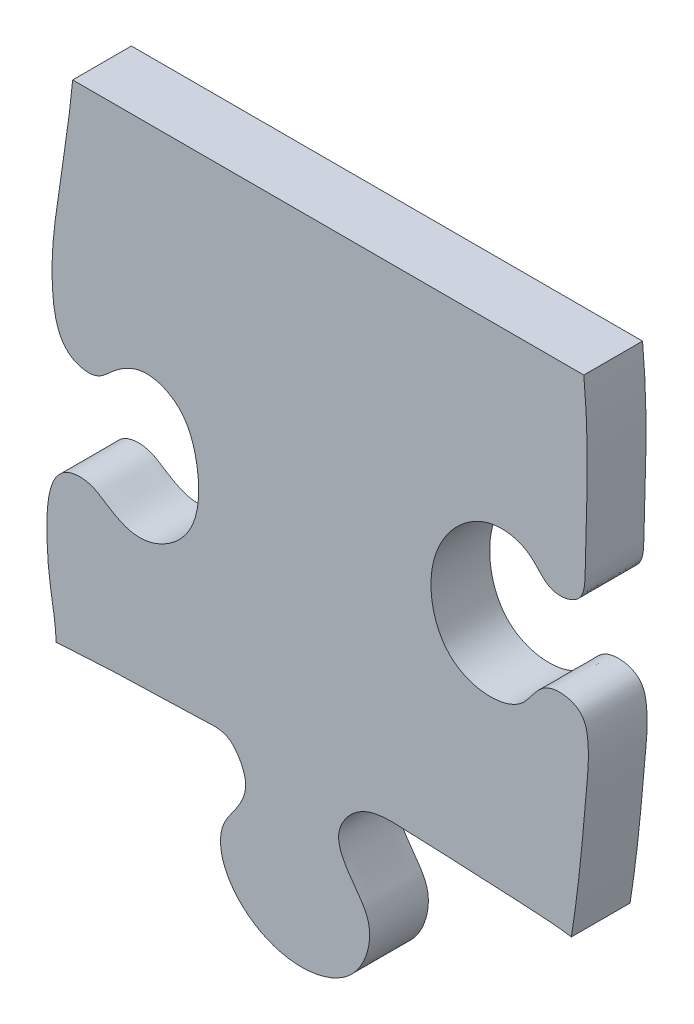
ISO-10303-21;
HEADER;
FILE_DESCRIPTION(('STEP AP214'),'2;1');
FILE_NAME('part.step','',(''),(''),'','','');
FILE_SCHEMA(('AUTOMOTIVE_DESIGN { 1 0 10303 214 1 1 1 1 }'));
ENDSEC;
DATA;
#1=APPLICATION_CONTEXT('core data for automotive mechanical design processes');
#2=APPLICATION_PROTOCOL_DEFINITION('international standard','automotive_design',2000,#1);
#3=PRODUCT_CONTEXT('',#1,'mechanical');
#4=PRODUCT('Part','Part','',(#3));
#5=PRODUCT_RELATED_PRODUCT_CATEGORY('part','',(#4));
#6=PRODUCT_DEFINITION_FORMATION('','',#4);
#7=PRODUCT_DEFINITION_CONTEXT('part definition',#1,'design');
#8=PRODUCT_DEFINITION('design','',#6,#7);
#9=PRODUCT_DEFINITION_SHAPE('','',#8);
#10=(LENGTH_UNIT() NAMED_UNIT(*) SI_UNIT(.MILLI.,.METRE.));
#11=(NAMED_UNIT(*) PLANE_ANGLE_UNIT() SI_UNIT($,.RADIAN.));
#12=(NAMED_UNIT(*) SI_UNIT($,.STERADIAN.) SOLID_ANGLE_UNIT());
#13=UNCERTAINTY_MEASURE_WITH_UNIT(LENGTH_MEASURE(1.E-05),#10,'distance_accuracy_value','');
#14=(GEOMETRIC_REPRESENTATION_CONTEXT(3) GLOBAL_UNCERTAINTY_ASSIGNED_CONTEXT((#13)) GLOBAL_UNIT_ASSIGNED_CONTEXT((#10,
#11,#12)) REPRESENTATION_CONTEXT('',''));
#15=CARTESIAN_POINT('',(0.,0.,0.));
#16=DIRECTION('',(0.,0.,1.));
#17=DIRECTION('',(1.,0.,0.));
#18=AXIS2_PLACEMENT_3D('',#15,#16,#17);
#19=CARTESIAN_POINT('',(164.700455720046,356.,-0.00999999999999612));
#20=CARTESIAN_POINT('',(166.684488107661,335.198470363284,-0.00999999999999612));
#21=CARTESIAN_POINT('',(165.501961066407,316.54844325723,-0.00999999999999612));
#22=CARTESIAN_POINT('',(164.960386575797,287.97241381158,-0.00999999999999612));
#23=CARTESIAN_POINT('',(152.647306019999,285.390744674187,-0.00999999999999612));
#24=CARTESIAN_POINT('',(146.755099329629,295.454986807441,-0.00999999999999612));
#25=CARTESIAN_POINT('',(133.057911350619,298.241097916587,-0.00999999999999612));
#26=CARTESIAN_POINT('',(118.543117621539,289.096389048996,-0.00999999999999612));
#27=CARTESIAN_POINT('',(110.066069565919,270.786201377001,-0.00999999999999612));
#28=CARTESIAN_POINT('',(115.81886117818,249.01949577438,-0.00999999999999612));
#29=CARTESIAN_POINT('',(132.43055469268,243.861484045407,-0.00999999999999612));
#30=CARTESIAN_POINT('',(145.190771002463,247.721589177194,-0.00999999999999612));
#31=CARTESIAN_POINT('',(150.073688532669,259.755128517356,-0.00999999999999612));
#32=CARTESIAN_POINT('',(164.873456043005,258.011209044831,-0.00999999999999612));
#33=CARTESIAN_POINT('',(166.852874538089,244.914449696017,-0.00999999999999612));
#34=CARTESIAN_POINT('',(165.64887314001,235.496089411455,-0.00999999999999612));
#35=CARTESIAN_POINT('',(164.287273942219,218.693357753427,-0.00999999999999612));
#36=CARTESIAN_POINT('',(162.190296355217,197.368034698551,-0.00999999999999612));
#37=CARTESIAN_POINT('',(156.3242571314,163.987545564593,-0.00999999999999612));
#38=CARTESIAN_POINT('',(154.411282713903,133.17643128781,-0.00999999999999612));
#39=CARTESIAN_POINT('',(156.534624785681,107.79955112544,-0.00999999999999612));
#40=CARTESIAN_POINT('',(165.683431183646,96.7362595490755,-0.00999999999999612));
#41=CARTESIAN_POINT('',(175.741034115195,97.7165246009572,-0.00999999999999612));
#42=CARTESIAN_POINT('',(178.913476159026,105.433342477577,-0.00999999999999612));
#43=CARTESIAN_POINT('',(187.788546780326,107.088038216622,-0.00999999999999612));
#44=CARTESIAN_POINT('',(196.945345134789,104.662624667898,-0.00999999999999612));
#45=CARTESIAN_POINT('',(205.29981235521,92.5405980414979,-0.00999999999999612));
#46=CARTESIAN_POINT('',(205.41693478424,76.2178133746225,-0.00999999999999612));
#47=CARTESIAN_POINT('',(199.239540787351,59.8870096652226,-0.00999999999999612));
#48=CARTESIAN_POINT('',(186.871281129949,54.774238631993,-0.00999999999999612));
#49=CARTESIAN_POINT('',(176.156697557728,56.844920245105,-0.00999999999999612));
#50=CARTESIAN_POINT('',(170.099360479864,65.2771221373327,-0.00999999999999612));
#51=CARTESIAN_POINT('',(157.970826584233,62.7514417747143,-0.00999999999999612));
#52=CARTESIAN_POINT('',(154.504441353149,46.6972732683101,-0.00999999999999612));
#53=CARTESIAN_POINT('',(156.826886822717,28.5222575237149,-0.00999999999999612));
#54=CARTESIAN_POINT('',(160.951813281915,-0.904965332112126,-0.00999999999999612));
#55=CARTESIAN_POINT('',(160.817443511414,-23.2712614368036,-0.00999999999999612));
#56=CARTESIAN_POINT('',(159.515162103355,-48.5242453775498,-0.00999999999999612));
#57=CARTESIAN_POINT('',(159.855435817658,-66.2012023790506,-0.00999999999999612));
#58=CARTESIAN_POINT('',(174.098925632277,-64.1326131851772,-0.00999999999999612));
#59=CARTESIAN_POINT('',(178.558905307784,-57.1982656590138,-0.00999999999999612));
#60=CARTESIAN_POINT('',(189.170801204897,-53.4758485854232,-0.00999999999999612));
#61=CARTESIAN_POINT('',(204.121791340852,-56.9229006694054,-0.00999999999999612));
#62=CARTESIAN_POINT('',(214.382314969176,-74.3254117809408,-0.00999999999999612));
#63=CARTESIAN_POINT('',(212.434433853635,-94.56819618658,-0.00999999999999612));
#64=CARTESIAN_POINT('',(198.400882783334,-105.927100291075,-0.00999999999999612));
#65=CARTESIAN_POINT('',(183.864051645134,-103.318484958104,-0.00999999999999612));
#66=CARTESIAN_POINT('',(177.484460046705,-92.9196706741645,-0.00999999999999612));
#67=CARTESIAN_POINT('',(166.612136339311,-90.3684772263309,-0.00999999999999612));
#68=CARTESIAN_POINT('',(160.072685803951,-95.573386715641,-0.00999999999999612));
#69=CARTESIAN_POINT('',(159.605088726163,-111.518801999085,-0.00999999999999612));
#70=CARTESIAN_POINT('',(161.971531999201,-132.152629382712,-0.00999999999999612));
#71=CARTESIAN_POINT('',(165.531009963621,-165.300059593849,-0.00999999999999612));
#72=CARTESIAN_POINT('',(167.927544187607,-195.365052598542,-0.00999999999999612));
#73=CARTESIAN_POINT('',(172.57489134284,-240.687787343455,-0.00999999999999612));
#74=CARTESIAN_POINT('',(151.998880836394,-237.677540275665,-0.00999999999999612));
#75=CARTESIAN_POINT('',(144.556929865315,-230.426442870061,-0.00999999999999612));
#76=CARTESIAN_POINT('',(127.822205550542,-229.966972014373,-0.00999999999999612));
#77=CARTESIAN_POINT('',(119.338975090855,-241.300441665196,-0.00999999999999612));
#78=CARTESIAN_POINT('',(116.55363668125,-259.024274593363,-0.00999999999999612));
#79=CARTESIAN_POINT('',(116.920126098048,-276.665079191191,-0.00999999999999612));
#80=CARTESIAN_POINT('',(139.807593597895,-286.808161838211,-0.00999999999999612));
#81=CARTESIAN_POINT('',(149.426451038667,-271.120437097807,-0.00999999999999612));
#82=CARTESIAN_POINT('',(164.833722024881,-276.098774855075,-0.00999999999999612));
#83=CARTESIAN_POINT('',(167.534498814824,-298.611176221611,-0.00999999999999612));
#84=CARTESIAN_POINT('',(167.66539945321,-324.44648435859,-0.00999999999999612));
#85=CARTESIAN_POINT('',(167.206886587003,-345.801767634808,-0.00999999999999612));
#86=CARTESIAN_POINT('',(167.126415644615,-356.,-0.00999999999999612));
#87=B_SPLINE_CURVE_WITH_KNOTS('',3,(#19,#20,#21,#22,#23,#24,#25,#26,#27,#28,#29,#30,#31,#32,#33,
#34,#35,#36,#37,#38,#39,#40,#41,#42,#43,#44,#45,#46,#47,#48,#49,#50,#51,#52,#53,#54,#55,#56,#57,
#58,#59,#60,#61,#62,#63,#64,#65,#66,#67,#68,#69,#70,#71,#72,#73,#74,#75,#76,#77,#78,#79,#80,#81,
#82,#83,#84,#85,#86),.UNSPECIFIED.,.F.,.F.,(4,1,1,1,1,1,1,1,1,1,1,1,1,1,1,1,1,1,1,1,1,1,1,1,1,1,
1,1,1,1,1,1,1,1,1,1,1,1,1,1,1,1,1,1,1,1,1,1,1,1,1,1,1,1,1,1,1,1,1,1,1,1,1,1,1,4),(0.,
0.0528861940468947,0.0611638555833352,0.0696733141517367,0.078438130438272,0.090018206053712,
0.103675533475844,0.122333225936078,0.142560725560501,0.155895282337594,0.165515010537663,
0.176439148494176,0.187171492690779,0.194785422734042,0.209132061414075,0.213814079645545,
0.241605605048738,0.267229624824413,0.306753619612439,0.326390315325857,0.335466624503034,
0.342457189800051,0.349640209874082,0.355564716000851,0.365339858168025,0.374043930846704,
0.393709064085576,0.408072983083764,0.418687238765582,0.427525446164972,0.43602306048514,
0.444515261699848,0.454494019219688,0.476412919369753,0.496275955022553,0.534624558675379,
0.541144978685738,0.561480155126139,0.567662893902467,0.574392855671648,0.583113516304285,
0.596680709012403,0.612912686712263,0.634082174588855,0.646626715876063,0.657822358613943,
0.669754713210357,0.678210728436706,0.685129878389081,0.689092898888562,0.71784093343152,
0.747115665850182,0.77522808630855,0.815611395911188,0.819725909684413,0.828398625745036,
0.84335213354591,0.85870373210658,0.863219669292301,0.888511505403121,0.901615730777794,
0.918667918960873,0.92637935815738,0.939283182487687,0.973955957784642,1.),.UNSPECIFIED.);
#88=DIRECTION('',(0.,0.,1.));
#89=VECTOR('',#88,1.);
#90=SURFACE_OF_LINEAR_EXTRUSION('',#87,#89);
#91=DIRECTION('',(0.,0.,1.));
#92=VECTOR('',#91,1.);
#93=CARTESIAN_POINT('',(160.461892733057,188.122695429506,-0.00999999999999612));
#94=LINE('',#93,#92);
#95=CARTESIAN_POINT('',(160.461892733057,188.122695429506,20.));
#96=VERTEX_POINT('',#95);
#97=CARTESIAN_POINT('',(160.461892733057,188.122695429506,0.));
#98=VERTEX_POINT('',#97);
#99=EDGE_CURVE('E82',#96,#98,#94,.F.);
#100=ORIENTED_EDGE('',*,*,#99,.T.);
#101=CARTESIAN_POINT('',(164.700455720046,356.,0.));
#102=CARTESIAN_POINT('',(166.684488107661,335.198470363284,0.));
#103=CARTESIAN_POINT('',(165.501961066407,316.54844325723,0.));
#104=CARTESIAN_POINT('',(164.960386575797,287.97241381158,0.));
#105=CARTESIAN_POINT('',(152.647306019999,285.390744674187,0.));
#106=CARTESIAN_POINT('',(146.755099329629,295.454986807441,0.));
#107=CARTESIAN_POINT('',(133.057911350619,298.241097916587,0.));
#108=CARTESIAN_POINT('',(118.543117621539,289.096389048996,0.));
#109=CARTESIAN_POINT('',(110.066069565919,270.786201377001,0.));
#110=CARTESIAN_POINT('',(115.81886117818,249.01949577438,0.));
#111=CARTESIAN_POINT('',(132.43055469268,243.861484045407,0.));
#112=CARTESIAN_POINT('',(145.190771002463,247.721589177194,0.));
#113=CARTESIAN_POINT('',(150.073688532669,259.755128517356,0.));
#114=CARTESIAN_POINT('',(164.873456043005,258.011209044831,0.));
#115=CARTESIAN_POINT('',(166.852874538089,244.914449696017,0.));
#116=CARTESIAN_POINT('',(165.64887314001,235.496089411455,0.));
#117=CARTESIAN_POINT('',(164.287273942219,218.693357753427,0.));
#118=CARTESIAN_POINT('',(162.190296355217,197.368034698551,0.));
#119=CARTESIAN_POINT('',(156.3242571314,163.987545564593,0.));
#120=CARTESIAN_POINT('',(154.411282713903,133.17643128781,0.));
#121=CARTESIAN_POINT('',(156.534624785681,107.79955112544,0.));
#122=CARTESIAN_POINT('',(165.683431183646,96.7362595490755,0.));
#123=CARTESIAN_POINT('',(175.741034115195,97.7165246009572,0.));
#124=CARTESIAN_POINT('',(178.913476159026,105.433342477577,0.));
#125=CARTESIAN_POINT('',(187.788546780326,107.088038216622,0.));
#126=CARTESIAN_POINT('',(196.945345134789,104.662624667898,0.));
#127=CARTESIAN_POINT('',(205.29981235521,92.5405980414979,0.));
#128=CARTESIAN_POINT('',(205.41693478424,76.2178133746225,0.));
#129=CARTESIAN_POINT('',(199.239540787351,59.8870096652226,0.));
#130=CARTESIAN_POINT('',(186.871281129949,54.774238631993,0.));
#131=CARTESIAN_POINT('',(176.156697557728,56.844920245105,0.));
#132=CARTESIAN_POINT('',(170.099360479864,65.2771221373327,0.));
#133=CARTESIAN_POINT('',(157.970826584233,62.7514417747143,0.));
#134=CARTESIAN_POINT('',(154.504441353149,46.6972732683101,0.));
#135=CARTESIAN_POINT('',(156.826886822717,28.5222575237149,0.));
#136=CARTESIAN_POINT('',(160.951813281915,-0.904965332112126,0.));
#137=CARTESIAN_POINT('',(160.817443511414,-23.2712614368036,0.));
#138=CARTESIAN_POINT('',(159.515162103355,-48.5242453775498,0.));
#139=CARTESIAN_POINT('',(159.855435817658,-66.2012023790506,0.));
#140=CARTESIAN_POINT('',(174.098925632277,-64.1326131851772,0.));
#141=CARTESIAN_POINT('',(178.558905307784,-57.1982656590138,0.));
#142=CARTESIAN_POINT('',(189.170801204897,-53.4758485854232,0.));
#143=CARTESIAN_POINT('',(204.121791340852,-56.9229006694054,0.));
#144=CARTESIAN_POINT('',(214.382314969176,-74.3254117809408,0.));
#145=CARTESIAN_POINT('',(212.434433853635,-94.56819618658,0.));
#146=CARTESIAN_POINT('',(198.400882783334,-105.927100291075,0.));
#147=CARTESIAN_POINT('',(183.864051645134,-103.318484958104,0.));
#148=CARTESIAN_POINT('',(177.484460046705,-92.9196706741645,0.));
#149=CARTESIAN_POINT('',(166.612136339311,-90.3684772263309,0.));
#150=CARTESIAN_POINT('',(160.072685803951,-95.573386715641,0.));
#151=CARTESIAN_POINT('',(159.605088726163,-111.518801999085,0.));
#152=CARTESIAN_POINT('',(161.971531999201,-132.152629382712,0.));
#153=CARTESIAN_POINT('',(165.531009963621,-165.300059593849,0.));
#154=CARTESIAN_POINT('',(167.927544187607,-195.365052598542,0.));
#155=CARTESIAN_POINT('',(172.57489134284,-240.687787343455,0.));
#156=CARTESIAN_POINT('',(151.998880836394,-237.677540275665,0.));
#157=CARTESIAN_POINT('',(144.556929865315,-230.426442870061,0.));
#158=CARTESIAN_POINT('',(127.822205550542,-229.966972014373,0.));
#159=CARTESIAN_POINT('',(119.338975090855,-241.300441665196,0.));
#160=CARTESIAN_POINT('',(116.55363668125,-259.024274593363,0.));
#161=CARTESIAN_POINT('',(116.920126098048,-276.665079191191,0.));
#162=CARTESIAN_POINT('',(139.807593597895,-286.808161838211,0.));
#163=CARTESIAN_POINT('',(149.426451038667,-271.120437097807,0.));
#164=CARTESIAN_POINT('',(164.833722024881,-276.098774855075,0.));
#165=CARTESIAN_POINT('',(167.534498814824,-298.611176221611,0.));
#166=CARTESIAN_POINT('',(167.66539945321,-324.44648435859,0.));
#167=CARTESIAN_POINT('',(167.206886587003,-345.801767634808,0.));
#168=CARTESIAN_POINT('',(167.126415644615,-356.,0.));
#169=B_SPLINE_CURVE_WITH_KNOTS('',3,(#101,#102,#103,#104,#105,#106,#107,#108,#109,#110,#111,
#112,#113,#114,#115,#116,#117,#118,#119,#120,#121,#122,#123,#124,#125,#126,#127,#128,#129,#130,
#131,#132,#133,#134,#135,#136,#137,#138,#139,#140,#141,#142,#143,#144,#145,#146,#147,#148,#149,
#150,#151,#152,#153,#154,#155,#156,#157,#158,#159,#160,#161,#162,#163,#164,#165,#166,#167,#168),
.UNSPECIFIED.,.F.,.F.,(4,1,1,1,1,1,1,1,1,1,1,1,1,1,1,1,1,1,1,1,1,1,1,1,1,1,1,1,1,1,1,1,1,1,1,1,
1,1,1,1,1,1,1,1,1,1,1,1,1,1,1,1,1,1,1,1,1,1,1,1,1,1,1,1,1,4),(0.,0.0528861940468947,
0.0611638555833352,0.0696733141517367,0.078438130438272,0.090018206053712,0.103675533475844,
0.122333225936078,0.142560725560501,0.155895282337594,0.165515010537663,0.176439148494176,
0.187171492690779,0.194785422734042,0.209132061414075,0.213814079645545,0.241605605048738,
0.267229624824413,0.306753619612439,0.326390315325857,0.335466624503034,0.342457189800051,
0.349640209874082,0.355564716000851,0.365339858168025,0.374043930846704,0.393709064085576,
0.408072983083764,0.418687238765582,0.427525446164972,0.43602306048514,0.444515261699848,
0.454494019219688,0.476412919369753,0.496275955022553,0.534624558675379,0.541144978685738,
0.561480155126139,0.567662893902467,0.574392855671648,0.583113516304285,0.596680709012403,
0.612912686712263,0.634082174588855,0.646626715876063,0.657822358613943,0.669754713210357,
0.678210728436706,0.685129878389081,0.689092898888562,0.71784093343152,0.747115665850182,
0.77522808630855,0.815611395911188,0.819725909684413,0.828398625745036,0.84335213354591,
0.85870373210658,0.863219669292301,0.888511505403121,0.901615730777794,0.918667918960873,
0.92637935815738,0.939283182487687,0.973955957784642,1.),.UNSPECIFIED.);
#170=CARTESIAN_POINT('',(164.700455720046,356.,0.));
#171=VERTEX_POINT('',#170);
#172=EDGE_CURVE('E112',#171,#98,#169,.T.);
#173=ORIENTED_EDGE('',*,*,#172,.F.);
#174=DIRECTION('',(0.,0.,1.));
#175=VECTOR('',#174,1.);
#176=CARTESIAN_POINT('',(164.700455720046,356.,-0.00999999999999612));
#177=LINE('',#176,#175);
#178=CARTESIAN_POINT('',(164.700455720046,356.,20.));
#179=VERTEX_POINT('',#178);
#180=EDGE_CURVE('E83',#179,#171,#177,.F.);
#181=ORIENTED_EDGE('',*,*,#180,.F.);
#182=CARTESIAN_POINT('',(164.700455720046,356.,20.));
#183=CARTESIAN_POINT('',(166.684488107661,335.198470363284,20.));
#184=CARTESIAN_POINT('',(165.501961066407,316.54844325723,20.));
#185=CARTESIAN_POINT('',(164.960386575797,287.97241381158,20.));
#186=CARTESIAN_POINT('',(152.647306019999,285.390744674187,20.));
#187=CARTESIAN_POINT('',(146.755099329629,295.454986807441,20.));
#188=CARTESIAN_POINT('',(133.057911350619,298.241097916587,20.));
#189=CARTESIAN_POINT('',(118.543117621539,289.096389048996,20.));
#190=CARTESIAN_POINT('',(110.066069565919,270.786201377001,20.));
#191=CARTESIAN_POINT('',(115.81886117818,249.01949577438,20.));
#192=CARTESIAN_POINT('',(132.43055469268,243.861484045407,20.));
#193=CARTESIAN_POINT('',(145.190771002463,247.721589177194,20.));
#194=CARTESIAN_POINT('',(150.073688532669,259.755128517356,20.));
#195=CARTESIAN_POINT('',(164.873456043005,258.011209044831,20.));
#196=CARTESIAN_POINT('',(166.852874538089,244.914449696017,20.));
#197=CARTESIAN_POINT('',(165.64887314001,235.496089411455,20.));
#198=CARTESIAN_POINT('',(164.287273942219,218.693357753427,20.));
#199=CARTESIAN_POINT('',(162.190296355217,197.368034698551,20.));
#200=CARTESIAN_POINT('',(156.3242571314,163.987545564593,20.));
#201=CARTESIAN_POINT('',(154.411282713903,133.17643128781,20.));
#202=CARTESIAN_POINT('',(156.534624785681,107.79955112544,20.));
#203=CARTESIAN_POINT('',(165.683431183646,96.7362595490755,20.));
#204=CARTESIAN_POINT('',(175.741034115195,97.7165246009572,20.));
#205=CARTESIAN_POINT('',(178.913476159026,105.433342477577,20.));
#206=CARTESIAN_POINT('',(187.788546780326,107.088038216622,20.));
#207=CARTESIAN_POINT('',(196.945345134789,104.662624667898,20.));
#208=CARTESIAN_POINT('',(205.29981235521,92.5405980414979,20.));
#209=CARTESIAN_POINT('',(205.41693478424,76.2178133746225,20.));
#210=CARTESIAN_POINT('',(199.239540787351,59.8870096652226,20.));
#211=CARTESIAN_POINT('',(186.871281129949,54.774238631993,20.));
#212=CARTESIAN_POINT('',(176.156697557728,56.844920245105,20.));
#213=CARTESIAN_POINT('',(170.099360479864,65.2771221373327,20.));
#214=CARTESIAN_POINT('',(157.970826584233,62.7514417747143,20.));
#215=CARTESIAN_POINT('',(154.504441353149,46.6972732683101,20.));
#216=CARTESIAN_POINT('',(156.826886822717,28.5222575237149,20.));
#217=CARTESIAN_POINT('',(160.951813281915,-0.904965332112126,20.));
#218=CARTESIAN_POINT('',(160.817443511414,-23.2712614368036,20.));
#219=CARTESIAN_POINT('',(159.515162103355,-48.5242453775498,20.));
#220=CARTESIAN_POINT('',(159.855435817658,-66.2012023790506,20.));
#221=CARTESIAN_POINT('',(174.098925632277,-64.1326131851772,20.));
#222=CARTESIAN_POINT('',(178.558905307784,-57.1982656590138,20.));
#223=CARTESIAN_POINT('',(189.170801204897,-53.4758485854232,20.));
#224=CARTESIAN_POINT('',(204.121791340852,-56.9229006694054,20.));
#225=CARTESIAN_POINT('',(214.382314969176,-74.3254117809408,20.));
#226=CARTESIAN_POINT('',(212.434433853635,-94.56819618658,20.));
#227=CARTESIAN_POINT('',(198.400882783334,-105.927100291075,20.));
#228=CARTESIAN_POINT('',(183.864051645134,-103.318484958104,20.));
#229=CARTESIAN_POINT('',(177.484460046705,-92.9196706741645,20.));
#230=CARTESIAN_POINT('',(166.612136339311,-90.3684772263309,20.));
#231=CARTESIAN_POINT('',(160.072685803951,-95.573386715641,20.));
#232=CARTESIAN_POINT('',(159.605088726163,-111.518801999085,20.));
#233=CARTESIAN_POINT('',(161.971531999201,-132.152629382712,20.));
#234=CARTESIAN_POINT('',(165.531009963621,-165.300059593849,20.));
#235=CARTESIAN_POINT('',(167.927544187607,-195.365052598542,20.));
#236=CARTESIAN_POINT('',(172.57489134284,-240.687787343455,20.));
#237=CARTESIAN_POINT('',(151.998880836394,-237.677540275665,20.));
#238=CARTESIAN_POINT('',(144.556929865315,-230.426442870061,20.));
#239=CARTESIAN_POINT('',(127.822205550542,-229.966972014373,20.));
#240=CARTESIAN_POINT('',(119.338975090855,-241.300441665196,20.));
#241=CARTESIAN_POINT('',(116.55363668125,-259.024274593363,20.));
#242=CARTESIAN_POINT('',(116.920126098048,-276.665079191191,20.));
#243=CARTESIAN_POINT('',(139.807593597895,-286.808161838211,20.));
#244=CARTESIAN_POINT('',(149.426451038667,-271.120437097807,20.));
#245=CARTESIAN_POINT('',(164.833722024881,-276.098774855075,20.));
#246=CARTESIAN_POINT('',(167.534498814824,-298.611176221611,20.));
#247=CARTESIAN_POINT('',(167.66539945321,-324.44648435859,20.));
#248=CARTESIAN_POINT('',(167.206886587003,-345.801767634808,20.));
#249=CARTESIAN_POINT('',(167.126415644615,-356.,20.));
#250=B_SPLINE_CURVE_WITH_KNOTS('',3,(#182,#183,#184,#185,#186,#187,#188,#189,#190,#191,#192,
#193,#194,#195,#196,#197,#198,#199,#200,#201,#202,#203,#204,#205,#206,#207,#208,#209,#210,#211,
#212,#213,#214,#215,#216,#217,#218,#219,#220,#221,#222,#223,#224,#225,#226,#227,#228,#229,#230,
#231,#232,#233,#234,#235,#236,#237,#238,#239,#240,#241,#242,#243,#244,#245,#246,#247,#248,#249),
.UNSPECIFIED.,.F.,.F.,(4,1,1,1,1,1,1,1,1,1,1,1,1,1,1,1,1,1,1,1,1,1,1,1,1,1,1,1,1,1,1,1,1,1,1,1,
1,1,1,1,1,1,1,1,1,1,1,1,1,1,1,1,1,1,1,1,1,1,1,1,1,1,1,1,1,4),(0.,0.0528861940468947,
0.0611638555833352,0.0696733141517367,0.078438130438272,0.090018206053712,0.103675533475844,
0.122333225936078,0.142560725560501,0.155895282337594,0.165515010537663,0.176439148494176,
0.187171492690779,0.194785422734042,0.209132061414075,0.213814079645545,0.241605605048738,
0.267229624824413,0.306753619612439,0.326390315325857,0.335466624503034,0.342457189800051,
0.349640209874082,0.355564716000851,0.365339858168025,0.374043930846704,0.393709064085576,
0.408072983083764,0.418687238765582,0.427525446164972,0.43602306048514,0.444515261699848,
0.454494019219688,0.476412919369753,0.496275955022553,0.534624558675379,0.541144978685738,
0.561480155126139,0.567662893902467,0.574392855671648,0.583113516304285,0.596680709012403,
0.612912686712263,0.634082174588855,0.646626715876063,0.657822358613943,0.669754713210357,
0.678210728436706,0.685129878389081,0.689092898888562,0.71784093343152,0.747115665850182,
0.77522808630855,0.815611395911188,0.819725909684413,0.828398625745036,0.84335213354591,
0.85870373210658,0.863219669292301,0.888511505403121,0.901615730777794,0.918667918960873,
0.92637935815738,0.939283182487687,0.973955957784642,1.),.UNSPECIFIED.);
#251=EDGE_CURVE('E79',#179,#96,#250,.T.);
#252=ORIENTED_EDGE('',*,*,#251,.T.);
#253=EDGE_LOOP('',(#100,#173,#181,#252));
#254=FACE_BOUND('',#253,.T.);
#255=ADVANCED_FACE('F34',(#254),#90,.F.);
#256=CARTESIAN_POINT('',(-9.39078729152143,356.,-0.00999999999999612));
#257=CARTESIAN_POINT('',(-10.6420004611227,342.109118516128,-0.00999999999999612));
#258=CARTESIAN_POINT('',(-14.6613121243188,319.56927935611,-0.00999999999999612));
#259=CARTESIAN_POINT('',(-17.4473947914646,293.08555207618,-0.00999999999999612));
#260=CARTESIAN_POINT('',(-13.8884373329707,273.667988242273,-0.00999999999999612));
#261=CARTESIAN_POINT('',(-1.07625820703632,271.397705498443,-0.00999999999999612));
#262=CARTESIAN_POINT('',(5.29309239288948,278.450722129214,-0.00999999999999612));
#263=CARTESIAN_POINT('',(14.9258759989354,283.741247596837,-0.00999999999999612));
#264=CARTESIAN_POINT('',(28.790892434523,278.335723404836,-0.00999999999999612));
#265=CARTESIAN_POINT('',(34.7382562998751,261.206713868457,-0.00999999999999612));
#266=CARTESIAN_POINT('',(33.1132905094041,240.122633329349,-0.00999999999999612));
#267=CARTESIAN_POINT('',(14.6676977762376,229.968331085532,-0.00999999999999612));
#268=CARTESIAN_POINT('',(3.42611827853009,235.442407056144,-0.00999999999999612));
#269=CARTESIAN_POINT('',(-2.96249564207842,240.393740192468,-0.00999999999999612));
#270=CARTESIAN_POINT('',(-18.0780076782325,240.138784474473,-0.00999999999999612));
#271=CARTESIAN_POINT('',(-18.5399667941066,222.992463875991,-0.00999999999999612));
#272=CARTESIAN_POINT('',(-17.4385931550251,202.827665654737,-0.00999999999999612));
#273=CARTESIAN_POINT('',(-14.0858554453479,190.221137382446,-0.00999999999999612));
#274=CARTESIAN_POINT('',(-15.5193743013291,175.136568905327,-0.00999999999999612));
#275=CARTESIAN_POINT('',(-16.6888175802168,157.648124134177,-0.00999999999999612));
#276=CARTESIAN_POINT('',(-17.7707660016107,144.240131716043,-0.00999999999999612));
#277=CARTESIAN_POINT('',(-17.3940925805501,124.109890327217,-0.00999999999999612));
#278=CARTESIAN_POINT('',(-18.6861496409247,110.985540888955,-0.00999999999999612));
#279=CARTESIAN_POINT('',(-3.94695866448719,101.126063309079,-0.00999999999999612));
#280=CARTESIAN_POINT('',(4.50824278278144,111.148466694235,-0.00999999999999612));
#281=CARTESIAN_POINT('',(13.1578407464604,120.870763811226,-0.00999999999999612));
#282=CARTESIAN_POINT('',(29.968112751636,122.314288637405,-0.00999999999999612));
#283=CARTESIAN_POINT('',(40.7223803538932,110.783826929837,-0.00999999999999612));
#284=CARTESIAN_POINT('',(45.7909417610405,94.3968136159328,-0.00999999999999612));
#285=CARTESIAN_POINT('',(43.9390810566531,75.8787758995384,-0.00999999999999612));
#286=CARTESIAN_POINT('',(30.503103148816,62.5847389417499,-0.00999999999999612));
#287=CARTESIAN_POINT('',(14.6986660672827,64.8647821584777,-0.00999999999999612));
#288=CARTESIAN_POINT('',(6.48631275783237,74.2887035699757,-0.00999999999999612));
#289=CARTESIAN_POINT('',(-2.74495882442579,80.3019272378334,-0.00999999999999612));
#290=CARTESIAN_POINT('',(-19.8840521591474,73.8019115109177,-0.00999999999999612));
#291=CARTESIAN_POINT('',(-15.1166354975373,44.269693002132,-0.00999999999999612));
#292=CARTESIAN_POINT('',(-13.5094217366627,17.7920418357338,-0.00999999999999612));
#293=CARTESIAN_POINT('',(-10.2430798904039,-1.06342782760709,-0.00999999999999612));
#294=CARTESIAN_POINT('',(-6.15123504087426,-23.5391381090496,-0.00999999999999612));
#295=CARTESIAN_POINT('',(-4.12992604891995,-48.8436757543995,-0.00999999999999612));
#296=CARTESIAN_POINT('',(-23.2142462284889,-47.7574601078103,-0.00999999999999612));
#297=CARTESIAN_POINT('',(-30.0018234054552,-40.5423137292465,-0.00999999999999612));
#298=CARTESIAN_POINT('',(-42.7528213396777,-39.1853410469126,-0.00999999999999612));
#299=CARTESIAN_POINT('',(-57.5092962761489,-47.8418744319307,-0.00999999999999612));
#300=CARTESIAN_POINT('',(-60.2210733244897,-67.5138769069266,-0.00999999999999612));
#301=CARTESIAN_POINT('',(-54.0018378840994,-88.1567638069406,-0.00999999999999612));
#302=CARTESIAN_POINT('',(-33.5101255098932,-90.2818581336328,-0.00999999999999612));
#303=CARTESIAN_POINT('',(-26.938266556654,-78.8436195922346,-0.00999999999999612));
#304=CARTESIAN_POINT('',(-16.0575989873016,-79.9605650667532,-0.00999999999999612));
#305=CARTESIAN_POINT('',(-9.29054500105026,-89.9843542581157,-0.00999999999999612));
#306=CARTESIAN_POINT('',(-9.26037942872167,-106.547726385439,-0.00999999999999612));
#307=CARTESIAN_POINT('',(-10.8655976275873,-129.908253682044,-0.00999999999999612));
#308=CARTESIAN_POINT('',(-18.080355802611,-155.05589418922,-0.00999999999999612));
#309=CARTESIAN_POINT('',(-15.5015350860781,-180.564325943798,-0.00999999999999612));
#310=CARTESIAN_POINT('',(-13.4534563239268,-202.72625863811,-0.00999999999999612));
#311=CARTESIAN_POINT('',(-13.0721771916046,-222.761537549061,-0.00999999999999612));
#312=CARTESIAN_POINT('',(-18.0801009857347,-237.162246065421,-0.00999999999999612));
#313=CARTESIAN_POINT('',(-28.3640065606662,-243.264641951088,-0.00999999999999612));
#314=CARTESIAN_POINT('',(-35.3195309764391,-234.565632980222,-0.00999999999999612));
#315=CARTESIAN_POINT('',(-45.5220607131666,-230.442721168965,-0.00999999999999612));
#316=CARTESIAN_POINT('',(-58.2826152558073,-236.227844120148,-0.00999999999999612));
#317=CARTESIAN_POINT('',(-63.2505187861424,-252.690663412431,-0.00999999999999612));
#318=CARTESIAN_POINT('',(-62.4331763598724,-269.758175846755,-0.00999999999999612));
#319=CARTESIAN_POINT('',(-51.5712190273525,-281.475483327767,-0.00999999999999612));
#320=CARTESIAN_POINT('',(-36.6120763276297,-283.519302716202,-0.00999999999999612));
#321=CARTESIAN_POINT('',(-27.825780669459,-270.933950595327,-0.00999999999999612));
#322=CARTESIAN_POINT('',(-10.9923291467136,-277.705324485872,-0.00999999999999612));
#323=CARTESIAN_POINT('',(-14.9884890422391,-312.557066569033,-0.00999999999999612));
#324=CARTESIAN_POINT('',(-14.8626828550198,-333.640060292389,-0.00999999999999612));
#325=CARTESIAN_POINT('',(-17.0261941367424,-356.,-0.00999999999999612));
#326=B_SPLINE_CURVE_WITH_KNOTS('',3,(#256,#257,#258,#259,#260,#261,#262,#263,#264,#265,#266,
#267,#268,#269,#270,#271,#272,#273,#274,#275,#276,#277,#278,#279,#280,#281,#282,#283,#284,#285,
#286,#287,#288,#289,#290,#291,#292,#293,#294,#295,#296,#297,#298,#299,#300,#301,#302,#303,#304,
#305,#306,#307,#308,#309,#310,#311,#312,#313,#314,#315,#316,#317,#318,#319,#320,#321,#322,#323,
#324,#325),.UNSPECIFIED.,.F.,.F.,(4,1,1,1,1,1,1,1,1,1,1,1,1,1,1,1,1,1,1,1,1,1,1,1,1,1,1,1,1,1,1,
1,1,1,1,1,1,1,1,1,1,1,1,1,1,1,1,1,1,1,1,1,1,1,1,1,1,1,1,1,1,1,1,1,1,1,1,4),(0.,
0.0382435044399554,0.06014267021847,0.0759154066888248,0.0830880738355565,0.0898528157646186,
0.100420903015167,0.110971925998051,0.125303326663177,0.146622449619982,0.16313068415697,
0.171984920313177,0.178976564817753,0.184846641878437,0.208558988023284,0.213294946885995,
0.232206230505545,0.247690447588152,0.25282597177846,0.280146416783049,0.285652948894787,
0.304476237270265,0.313783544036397,0.32377706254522,0.334253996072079,0.350240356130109,
0.361652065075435,0.37428972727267,0.396319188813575,0.408299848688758,0.421251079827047,
0.43387737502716,0.442611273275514,0.448402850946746,0.478919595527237,0.50340807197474,
0.525599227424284,0.531488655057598,0.562302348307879,0.569309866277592,0.576593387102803,
0.588291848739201,0.600948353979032,0.618957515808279,0.638096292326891,0.652011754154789,
0.663601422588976,0.667955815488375,0.679319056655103,0.692000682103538,0.712742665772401,
0.742765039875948,0.761777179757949,0.781638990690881,0.803327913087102,0.815753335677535,
0.82139602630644,0.831491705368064,0.840302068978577,0.85029925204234,0.865053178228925,
0.884091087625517,0.893653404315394,0.906570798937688,0.918850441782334,0.928550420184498,
0.945628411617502,1.),.UNSPECIFIED.);
#327=DIRECTION('',(0.,0.,1.));
#328=VECTOR('',#327,1.);
#329=SURFACE_OF_LINEAR_EXTRUSION('',#326,#328);
#330=DIRECTION('',(0.,0.,1.));
#331=VECTOR('',#330,1.);
#332=CARTESIAN_POINT('',(-15.0113557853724,187.327774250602,-0.00999999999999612));
#333=LINE('',#332,#331);
#334=CARTESIAN_POINT('',(-15.0113557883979,187.32777425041,20.));
#335=VERTEX_POINT('',#334);
#336=CARTESIAN_POINT('',(-15.0113557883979,187.32777425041,0.));
#337=VERTEX_POINT('',#336);
#338=EDGE_CURVE('E90',#335,#337,#333,.F.);
#339=ORIENTED_EDGE('',*,*,#338,.F.);
#340=CARTESIAN_POINT('',(-9.39078729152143,356.,20.));
#341=CARTESIAN_POINT('',(-10.6420004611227,342.109118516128,20.));
#342=CARTESIAN_POINT('',(-14.6613121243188,319.56927935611,20.));
#343=CARTESIAN_POINT('',(-17.4473947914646,293.08555207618,20.));
#344=CARTESIAN_POINT('',(-13.8884373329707,273.667988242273,20.));
#345=CARTESIAN_POINT('',(-1.07625820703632,271.397705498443,20.));
#346=CARTESIAN_POINT('',(5.29309239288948,278.450722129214,20.));
#347=CARTESIAN_POINT('',(14.9258759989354,283.741247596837,20.));
#348=CARTESIAN_POINT('',(28.790892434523,278.335723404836,20.));
#349=CARTESIAN_POINT('',(34.7382562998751,261.206713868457,20.));
#350=CARTESIAN_POINT('',(33.1132905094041,240.122633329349,20.));
#351=CARTESIAN_POINT('',(14.6676977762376,229.968331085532,20.));
#352=CARTESIAN_POINT('',(3.42611827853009,235.442407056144,20.));
#353=CARTESIAN_POINT('',(-2.96249564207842,240.393740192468,20.));
#354=CARTESIAN_POINT('',(-18.0780076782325,240.138784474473,20.));
#355=CARTESIAN_POINT('',(-18.5399667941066,222.992463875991,20.));
#356=CARTESIAN_POINT('',(-17.4385931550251,202.827665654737,20.));
#357=CARTESIAN_POINT('',(-14.0858554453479,190.221137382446,20.));
#358=CARTESIAN_POINT('',(-15.5193743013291,175.136568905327,20.));
#359=CARTESIAN_POINT('',(-16.6888175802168,157.648124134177,20.));
#360=CARTESIAN_POINT('',(-17.7707660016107,144.240131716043,20.));
#361=CARTESIAN_POINT('',(-17.3940925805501,124.109890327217,20.));
#362=CARTESIAN_POINT('',(-18.6861496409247,110.985540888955,20.));
#363=CARTESIAN_POINT('',(-3.94695866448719,101.126063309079,20.));
#364=CARTESIAN_POINT('',(4.50824278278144,111.148466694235,20.));
#365=CARTESIAN_POINT('',(13.1578407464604,120.870763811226,20.));
#366=CARTESIAN_POINT('',(29.968112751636,122.314288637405,20.));
#367=CARTESIAN_POINT('',(40.7223803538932,110.783826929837,20.));
#368=CARTESIAN_POINT('',(45.7909417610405,94.3968136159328,20.));
#369=CARTESIAN_POINT('',(43.9390810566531,75.8787758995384,20.));
#370=CARTESIAN_POINT('',(30.503103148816,62.5847389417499,20.));
#371=CARTESIAN_POINT('',(14.6986660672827,64.8647821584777,20.));
#372=CARTESIAN_POINT('',(6.48631275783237,74.2887035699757,20.));
#373=CARTESIAN_POINT('',(-2.74495882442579,80.3019272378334,20.));
#374=CARTESIAN_POINT('',(-19.8840521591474,73.8019115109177,20.));
#375=CARTESIAN_POINT('',(-15.1166354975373,44.269693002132,20.));
#376=CARTESIAN_POINT('',(-13.5094217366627,17.7920418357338,20.));
#377=CARTESIAN_POINT('',(-10.2430798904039,-1.06342782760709,20.));
#378=CARTESIAN_POINT('',(-6.15123504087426,-23.5391381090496,20.));
#379=CARTESIAN_POINT('',(-4.12992604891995,-48.8436757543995,20.));
#380=CARTESIAN_POINT('',(-23.2142462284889,-47.7574601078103,20.));
#381=CARTESIAN_POINT('',(-30.0018234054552,-40.5423137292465,20.));
#382=CARTESIAN_POINT('',(-42.7528213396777,-39.1853410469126,20.));
#383=CARTESIAN_POINT('',(-57.5092962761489,-47.8418744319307,20.));
#384=CARTESIAN_POINT('',(-60.2210733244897,-67.5138769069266,20.));
#385=CARTESIAN_POINT('',(-54.0018378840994,-88.1567638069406,20.));
#386=CARTESIAN_POINT('',(-33.5101255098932,-90.2818581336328,20.));
#387=CARTESIAN_POINT('',(-26.938266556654,-78.8436195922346,20.));
#388=CARTESIAN_POINT('',(-16.0575989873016,-79.9605650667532,20.));
#389=CARTESIAN_POINT('',(-9.29054500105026,-89.9843542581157,20.));
#390=CARTESIAN_POINT('',(-9.26037942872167,-106.547726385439,20.));
#391=CARTESIAN_POINT('',(-10.8655976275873,-129.908253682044,20.));
#392=CARTESIAN_POINT('',(-18.080355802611,-155.05589418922,20.));
#393=CARTESIAN_POINT('',(-15.5015350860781,-180.564325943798,20.));
#394=CARTESIAN_POINT('',(-13.4534563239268,-202.72625863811,20.));
#395=CARTESIAN_POINT('',(-13.0721771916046,-222.761537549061,20.));
#396=CARTESIAN_POINT('',(-18.0801009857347,-237.162246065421,20.));
#397=CARTESIAN_POINT('',(-28.3640065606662,-243.264641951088,20.));
#398=CARTESIAN_POINT('',(-35.3195309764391,-234.565632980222,20.));
#399=CARTESIAN_POINT('',(-45.5220607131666,-230.442721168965,20.));
#400=CARTESIAN_POINT('',(-58.2826152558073,-236.227844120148,20.));
#401=CARTESIAN_POINT('',(-63.2505187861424,-252.690663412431,20.));
#402=CARTESIAN_POINT('',(-62.4331763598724,-269.758175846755,20.));
#403=CARTESIAN_POINT('',(-51.5712190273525,-281.475483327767,20.));
#404=CARTESIAN_POINT('',(-36.6120763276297,-283.519302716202,20.));
#405=CARTESIAN_POINT('',(-27.825780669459,-270.933950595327,20.));
#406=CARTESIAN_POINT('',(-10.9923291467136,-277.705324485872,20.));
#407=CARTESIAN_POINT('',(-14.9884890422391,-312.557066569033,20.));
#408=CARTESIAN_POINT('',(-14.8626828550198,-333.640060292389,20.));
#409=CARTESIAN_POINT('',(-17.0261941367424,-356.,20.));
#410=B_SPLINE_CURVE_WITH_KNOTS('',3,(#340,#341,#342,#343,#344,#345,#346,#347,#348,#349,#350,
#351,#352,#353,#354,#355,#356,#357,#358,#359,#360,#361,#362,#363,#364,#365,#366,#367,#368,#369,
#370,#371,#372,#373,#374,#375,#376,#377,#378,#379,#380,#381,#382,#383,#384,#385,#386,#387,#388,
#389,#390,#391,#392,#393,#394,#395,#396,#397,#398,#399,#400,#401,#402,#403,#404,#405,#406,#407,
#408,#409),.UNSPECIFIED.,.F.,.F.,(4,1,1,1,1,1,1,1,1,1,1,1,1,1,1,1,1,1,1,1,1,1,1,1,1,1,1,1,1,1,1,
1,1,1,1,1,1,1,1,1,1,1,1,1,1,1,1,1,1,1,1,1,1,1,1,1,1,1,1,1,1,1,1,1,1,1,1,4),(0.,
0.0382435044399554,0.06014267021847,0.0759154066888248,0.0830880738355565,0.0898528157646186,
0.100420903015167,0.110971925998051,0.125303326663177,0.146622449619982,0.16313068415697,
0.171984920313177,0.178976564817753,0.184846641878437,0.208558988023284,0.213294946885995,
0.232206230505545,0.247690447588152,0.25282597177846,0.280146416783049,0.285652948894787,
0.304476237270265,0.313783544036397,0.32377706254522,0.334253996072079,0.350240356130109,
0.361652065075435,0.37428972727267,0.396319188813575,0.408299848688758,0.421251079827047,
0.43387737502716,0.442611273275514,0.448402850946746,0.478919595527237,0.50340807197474,
0.525599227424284,0.531488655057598,0.562302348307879,0.569309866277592,0.576593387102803,
0.588291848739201,0.600948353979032,0.618957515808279,0.638096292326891,0.652011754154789,
0.663601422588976,0.667955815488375,0.679319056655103,0.692000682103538,0.712742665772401,
0.742765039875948,0.761777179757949,0.781638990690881,0.803327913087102,0.815753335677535,
0.82139602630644,0.831491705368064,0.840302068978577,0.85029925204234,0.865053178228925,
0.884091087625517,0.893653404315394,0.906570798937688,0.918850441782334,0.928550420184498,
0.945628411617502,1.),.UNSPECIFIED.);
#411=CARTESIAN_POINT('',(-9.39078729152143,356.,20.));
#412=VERTEX_POINT('',#411);
#413=EDGE_CURVE('E53',#412,#335,#410,.T.);
#414=ORIENTED_EDGE('',*,*,#413,.F.);
#415=DIRECTION('',(0.,0.,1.));
#416=VECTOR('',#415,1.);
#417=CARTESIAN_POINT('',(-9.39078729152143,356.,-0.00999999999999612));
#418=LINE('',#417,#416);
#419=CARTESIAN_POINT('',(-9.39078729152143,356.,0.));
#420=VERTEX_POINT('',#419);
#421=EDGE_CURVE('E91',#412,#420,#418,.F.);
#422=ORIENTED_EDGE('',*,*,#421,.T.);
#423=CARTESIAN_POINT('',(-9.39078729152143,356.,0.));
#424=CARTESIAN_POINT('',(-10.6420004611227,342.109118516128,0.));
#425=CARTESIAN_POINT('',(-14.6613121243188,319.56927935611,0.));
#426=CARTESIAN_POINT('',(-17.4473947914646,293.08555207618,0.));
#427=CARTESIAN_POINT('',(-13.8884373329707,273.667988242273,0.));
#428=CARTESIAN_POINT('',(-1.07625820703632,271.397705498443,0.));
#429=CARTESIAN_POINT('',(5.29309239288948,278.450722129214,0.));
#430=CARTESIAN_POINT('',(14.9258759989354,283.741247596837,0.));
#431=CARTESIAN_POINT('',(28.790892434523,278.335723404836,0.));
#432=CARTESIAN_POINT('',(34.7382562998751,261.206713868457,0.));
#433=CARTESIAN_POINT('',(33.1132905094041,240.122633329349,0.));
#434=CARTESIAN_POINT('',(14.6676977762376,229.968331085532,0.));
#435=CARTESIAN_POINT('',(3.42611827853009,235.442407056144,0.));
#436=CARTESIAN_POINT('',(-2.96249564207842,240.393740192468,0.));
#437=CARTESIAN_POINT('',(-18.0780076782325,240.138784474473,0.));
#438=CARTESIAN_POINT('',(-18.5399667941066,222.992463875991,0.));
#439=CARTESIAN_POINT('',(-17.4385931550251,202.827665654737,0.));
#440=CARTESIAN_POINT('',(-14.0858554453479,190.221137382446,0.));
#441=CARTESIAN_POINT('',(-15.5193743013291,175.136568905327,0.));
#442=CARTESIAN_POINT('',(-16.6888175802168,157.648124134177,0.));
#443=CARTESIAN_POINT('',(-17.7707660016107,144.240131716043,0.));
#444=CARTESIAN_POINT('',(-17.3940925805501,124.109890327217,0.));
#445=CARTESIAN_POINT('',(-18.6861496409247,110.985540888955,0.));
#446=CARTESIAN_POINT('',(-3.94695866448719,101.126063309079,0.));
#447=CARTESIAN_POINT('',(4.50824278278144,111.148466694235,0.));
#448=CARTESIAN_POINT('',(13.1578407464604,120.870763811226,0.));
#449=CARTESIAN_POINT('',(29.968112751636,122.314288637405,0.));
#450=CARTESIAN_POINT('',(40.7223803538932,110.783826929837,0.));
#451=CARTESIAN_POINT('',(45.7909417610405,94.3968136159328,0.));
#452=CARTESIAN_POINT('',(43.9390810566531,75.8787758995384,0.));
#453=CARTESIAN_POINT('',(30.503103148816,62.5847389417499,0.));
#454=CARTESIAN_POINT('',(14.6986660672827,64.8647821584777,0.));
#455=CARTESIAN_POINT('',(6.48631275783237,74.2887035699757,0.));
#456=CARTESIAN_POINT('',(-2.74495882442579,80.3019272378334,0.));
#457=CARTESIAN_POINT('',(-19.8840521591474,73.8019115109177,0.));
#458=CARTESIAN_POINT('',(-15.1166354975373,44.269693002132,0.));
#459=CARTESIAN_POINT('',(-13.5094217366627,17.7920418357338,0.));
#460=CARTESIAN_POINT('',(-10.2430798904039,-1.06342782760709,0.));
#461=CARTESIAN_POINT('',(-6.15123504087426,-23.5391381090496,0.));
#462=CARTESIAN_POINT('',(-4.12992604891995,-48.8436757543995,0.));
#463=CARTESIAN_POINT('',(-23.2142462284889,-47.7574601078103,0.));
#464=CARTESIAN_POINT('',(-30.0018234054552,-40.5423137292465,0.));
#465=CARTESIAN_POINT('',(-42.7528213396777,-39.1853410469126,0.));
#466=CARTESIAN_POINT('',(-57.5092962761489,-47.8418744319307,0.));
#467=CARTESIAN_POINT('',(-60.2210733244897,-67.5138769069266,0.));
#468=CARTESIAN_POINT('',(-54.0018378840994,-88.1567638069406,0.));
#469=CARTESIAN_POINT('',(-33.5101255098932,-90.2818581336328,0.));
#470=CARTESIAN_POINT('',(-26.938266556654,-78.8436195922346,0.));
#471=CARTESIAN_POINT('',(-16.0575989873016,-79.9605650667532,0.));
#472=CARTESIAN_POINT('',(-9.29054500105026,-89.9843542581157,0.));
#473=CARTESIAN_POINT('',(-9.26037942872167,-106.547726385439,0.));
#474=CARTESIAN_POINT('',(-10.8655976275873,-129.908253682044,0.));
#475=CARTESIAN_POINT('',(-18.080355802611,-155.05589418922,0.));
#476=CARTESIAN_POINT('',(-15.5015350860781,-180.564325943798,0.));
#477=CARTESIAN_POINT('',(-13.4534563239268,-202.72625863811,0.));
#478=CARTESIAN_POINT('',(-13.0721771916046,-222.761537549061,0.));
#479=CARTESIAN_POINT('',(-18.0801009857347,-237.162246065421,0.));
#480=CARTESIAN_POINT('',(-28.3640065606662,-243.264641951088,0.));
#481=CARTESIAN_POINT('',(-35.3195309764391,-234.565632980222,0.));
#482=CARTESIAN_POINT('',(-45.5220607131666,-230.442721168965,0.));
#483=CARTESIAN_POINT('',(-58.2826152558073,-236.227844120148,0.));
#484=CARTESIAN_POINT('',(-63.2505187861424,-252.690663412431,0.));
#485=CARTESIAN_POINT('',(-62.4331763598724,-269.758175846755,0.));
#486=CARTESIAN_POINT('',(-51.5712190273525,-281.475483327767,0.));
#487=CARTESIAN_POINT('',(-36.6120763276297,-283.519302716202,0.));
#488=CARTESIAN_POINT('',(-27.825780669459,-270.933950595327,0.));
#489=CARTESIAN_POINT('',(-10.9923291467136,-277.705324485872,0.));
#490=CARTESIAN_POINT('',(-14.9884890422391,-312.557066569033,0.));
#491=CARTESIAN_POINT('',(-14.8626828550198,-333.640060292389,0.));
#492=CARTESIAN_POINT('',(-17.0261941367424,-356.,0.));
#493=B_SPLINE_CURVE_WITH_KNOTS('',3,(#423,#424,#425,#426,#427,#428,#429,#430,#431,#432,#433,
#434,#435,#436,#437,#438,#439,#440,#441,#442,#443,#444,#445,#446,#447,#448,#449,#450,#451,#452,
#453,#454,#455,#456,#457,#458,#459,#460,#461,#462,#463,#464,#465,#466,#467,#468,#469,#470,#471,
#472,#473,#474,#475,#476,#477,#478,#479,#480,#481,#482,#483,#484,#485,#486,#487,#488,#489,#490,
#491,#492),.UNSPECIFIED.,.F.,.F.,(4,1,1,1,1,1,1,1,1,1,1,1,1,1,1,1,1,1,1,1,1,1,1,1,1,1,1,1,1,1,1,
1,1,1,1,1,1,1,1,1,1,1,1,1,1,1,1,1,1,1,1,1,1,1,1,1,1,1,1,1,1,1,1,1,1,1,1,4),(0.,
0.0382435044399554,0.06014267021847,0.0759154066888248,0.0830880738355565,0.0898528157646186,
0.100420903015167,0.110971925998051,0.125303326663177,0.146622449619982,0.16313068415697,
0.171984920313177,0.178976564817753,0.184846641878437,0.208558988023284,0.213294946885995,
0.232206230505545,0.247690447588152,0.25282597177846,0.280146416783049,0.285652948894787,
0.304476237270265,0.313783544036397,0.32377706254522,0.334253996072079,0.350240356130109,
0.361652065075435,0.37428972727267,0.396319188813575,0.408299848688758,0.421251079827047,
0.43387737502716,0.442611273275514,0.448402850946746,0.478919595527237,0.50340807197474,
0.525599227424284,0.531488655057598,0.562302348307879,0.569309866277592,0.576593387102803,
0.588291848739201,0.600948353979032,0.618957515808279,0.638096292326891,0.652011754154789,
0.663601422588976,0.667955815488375,0.679319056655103,0.692000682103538,0.712742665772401,
0.742765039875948,0.761777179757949,0.781638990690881,0.803327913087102,0.815753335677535,
0.82139602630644,0.831491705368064,0.840302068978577,0.85029925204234,0.865053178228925,
0.884091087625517,0.893653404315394,0.906570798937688,0.918850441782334,0.928550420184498,
0.945628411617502,1.),.UNSPECIFIED.);
#494=EDGE_CURVE('E38',#420,#337,#493,.T.);
#495=ORIENTED_EDGE('',*,*,#494,.T.);
#496=EDGE_LOOP('',(#339,#414,#422,#495));
#497=FACE_BOUND('',#496,.T.);
#498=ADVANCED_FACE('F109',(#497),#329,.T.);
#499=CARTESIAN_POINT('',(-346.614016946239,177.25293926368,-0.00999999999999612));
#500=CARTESIAN_POINT('',(-342.258832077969,176.736071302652,-0.00999999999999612));
#501=CARTESIAN_POINT('',(-334.630281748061,175.39162503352,-0.00999999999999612));
#502=CARTESIAN_POINT('',(-322.207300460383,172.127174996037,-0.00999999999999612));
#503=CARTESIAN_POINT('',(-310.217613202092,171.698509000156,-0.00999999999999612));
#504=CARTESIAN_POINT('',(-298.545158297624,170.093475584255,-0.00999999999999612));
#505=CARTESIAN_POINT('',(-292.347039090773,176.459047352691,-0.00999999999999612));
#506=CARTESIAN_POINT('',(-291.182342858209,183.091468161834,-0.00999999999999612));
#507=CARTESIAN_POINT('',(-293.102487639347,190.125199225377,-0.00999999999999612));
#508=CARTESIAN_POINT('',(-298.136160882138,196.044180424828,-0.00999999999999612));
#509=CARTESIAN_POINT('',(-298.244257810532,205.192484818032,-0.00999999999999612));
#510=CARTESIAN_POINT('',(-295.736411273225,216.192904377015,-0.00999999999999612));
#511=CARTESIAN_POINT('',(-284.569633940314,223.791693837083,-0.00999999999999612));
#512=CARTESIAN_POINT('',(-272.468924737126,223.790848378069,-0.00999999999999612));
#513=CARTESIAN_POINT('',(-261.822732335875,221.83725535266,-0.00999999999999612));
#514=CARTESIAN_POINT('',(-253.508338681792,215.027886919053,-0.00999999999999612));
#515=CARTESIAN_POINT('',(-252.519805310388,205.637670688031,-0.00999999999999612));
#516=CARTESIAN_POINT('',(-253.401239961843,197.704569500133,-0.00999999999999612));
#517=CARTESIAN_POINT('',(-258.083644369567,192.838143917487,-0.00999999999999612));
#518=CARTESIAN_POINT('',(-261.982487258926,187.038073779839,-0.00999999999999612));
#519=CARTESIAN_POINT('',(-259.723590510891,179.281829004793,-0.00999999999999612));
#520=CARTESIAN_POINT('',(-251.85351516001,173.410794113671,-0.00999999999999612));
#521=CARTESIAN_POINT('',(-238.882669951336,174.366863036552,-0.00999999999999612));
#522=CARTESIAN_POINT('',(-223.106306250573,172.916178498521,-0.00999999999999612));
#523=CARTESIAN_POINT('',(-206.446351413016,177.519441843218,-0.00999999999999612));
#524=CARTESIAN_POINT('',(-190.340722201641,179.324744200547,-0.00999999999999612));
#525=CARTESIAN_POINT('',(-176.104340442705,182.349104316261,-0.00999999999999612));
#526=CARTESIAN_POINT('',(-163.084589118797,183.756571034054,-0.00999999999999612));
#527=CARTESIAN_POINT('',(-148.792468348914,185.344350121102,-0.00999999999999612));
#528=CARTESIAN_POINT('',(-133.845084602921,186.050988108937,-0.00999999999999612));
#529=CARTESIAN_POINT('',(-120.037545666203,188.092783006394,-0.00999999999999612));
#530=CARTESIAN_POINT('',(-111.803418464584,182.78300514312,-0.00999999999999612));
#531=CARTESIAN_POINT('',(-111.114798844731,176.517531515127,-0.00999999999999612));
#532=CARTESIAN_POINT('',(-112.872183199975,170.302712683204,-0.00999999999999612));
#533=CARTESIAN_POINT('',(-117.51230307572,165.00187907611,-0.00999999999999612));
#534=CARTESIAN_POINT('',(-123.315488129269,161.011850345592,-0.00999999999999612));
#535=CARTESIAN_POINT('',(-125.896005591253,153.215627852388,-0.00999999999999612));
#536=CARTESIAN_POINT('',(-123.567507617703,140.925485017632,-0.00999999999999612));
#537=CARTESIAN_POINT('',(-111.885113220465,130.083380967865,-0.00999999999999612));
#538=CARTESIAN_POINT('',(-95.9373878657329,129.405548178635,-0.00999999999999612));
#539=CARTESIAN_POINT('',(-84.8374492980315,134.872773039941,-0.00999999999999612));
#540=CARTESIAN_POINT('',(-75.3086923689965,142.091043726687,-0.00999999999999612));
#541=CARTESIAN_POINT('',(-72.69488446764,152.131847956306,-0.00999999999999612));
#542=CARTESIAN_POINT('',(-71.682221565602,162.525177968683,-0.00999999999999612));
#543=CARTESIAN_POINT('',(-78.7549399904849,168.95980357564,-0.00999999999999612));
#544=CARTESIAN_POINT('',(-85.5168727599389,177.593918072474,-0.00999999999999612));
#545=CARTESIAN_POINT('',(-75.9954684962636,187.469530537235,-0.00999999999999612));
#546=CARTESIAN_POINT('',(-67.465440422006,186.249883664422,-0.00999999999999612));
#547=CARTESIAN_POINT('',(-58.2366685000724,186.245624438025,-0.00999999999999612));
#548=CARTESIAN_POINT('',(-48.8132938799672,186.807289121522,-0.00999999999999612));
#549=CARTESIAN_POINT('',(-33.2056867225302,186.136328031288,-0.00999999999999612));
#550=CARTESIAN_POINT('',(-12.537524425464,187.517682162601,-0.00999999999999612));
#551=CARTESIAN_POINT('',(11.5103154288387,188.924750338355,-0.00999999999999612));
#552=CARTESIAN_POINT('',(30.1849441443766,189.011039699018,-0.00999999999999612));
#553=CARTESIAN_POINT('',(43.274525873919,189.889723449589,-0.00999999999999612));
#554=CARTESIAN_POINT('',(48.0164168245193,183.93060080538,-0.00999999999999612));
#555=CARTESIAN_POINT('',(50.5774279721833,176.61864331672,-0.00999999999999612));
#556=CARTESIAN_POINT('',(46.6862848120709,168.851584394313,-0.00999999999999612));
#557=CARTESIAN_POINT('',(40.9041593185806,162.199492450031,-0.00999999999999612));
#558=CARTESIAN_POINT('',(40.64695704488,152.479125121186,-0.00999999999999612));
#559=CARTESIAN_POINT('',(45.9753197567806,142.379370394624,-0.00999999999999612));
#560=CARTESIAN_POINT('',(57.8656738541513,133.606511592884,-0.00999999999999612));
#561=CARTESIAN_POINT('',(73.1959810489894,132.323999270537,-0.00999999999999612));
#562=CARTESIAN_POINT('',(85.4204286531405,138.139947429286,-0.00999999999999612));
#563=CARTESIAN_POINT('',(91.293500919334,147.271529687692,-0.00999999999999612));
#564=CARTESIAN_POINT('',(92.5730258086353,158.4481335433,-0.00999999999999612));
#565=CARTESIAN_POINT('',(85.6844462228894,167.316232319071,-0.00999999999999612));
#566=CARTESIAN_POINT('',(79.232667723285,177.018523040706,-0.00999999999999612));
#567=CARTESIAN_POINT('',(84.0194361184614,186.167590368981,-0.00999999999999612));
#568=CARTESIAN_POINT('',(92.1790662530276,191.943337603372,-0.00999999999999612));
#569=CARTESIAN_POINT('',(105.569170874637,191.361104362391,-0.00999999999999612));
#570=CARTESIAN_POINT('',(122.280046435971,190.653524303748,-0.00999999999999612));
#571=CARTESIAN_POINT('',(140.914243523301,189.654608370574,-0.00999999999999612));
#572=CARTESIAN_POINT('',(158.454428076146,188.894575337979,-0.00999999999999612));
#573=CARTESIAN_POINT('',(174.308585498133,185.327210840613,-0.00999999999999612));
#574=CARTESIAN_POINT('',(190.189391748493,182.787078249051,-0.00999999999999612));
#575=CARTESIAN_POINT('',(205.520873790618,180.707698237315,-0.00999999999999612));
#576=CARTESIAN_POINT('',(219.985633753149,180.329082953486,-0.00999999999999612));
#577=CARTESIAN_POINT('',(230.995486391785,184.637134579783,-0.00999999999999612));
#578=CARTESIAN_POINT('',(236.389631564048,193.96740057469,-0.00999999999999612));
#579=CARTESIAN_POINT('',(234.339311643,204.099038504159,-0.00999999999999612));
#580=CARTESIAN_POINT('',(225.306966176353,209.962524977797,-0.00999999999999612));
#581=CARTESIAN_POINT('',(217.656290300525,220.555550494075,-0.00999999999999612));
#582=CARTESIAN_POINT('',(221.434208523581,234.75430994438,-0.00999999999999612));
#583=CARTESIAN_POINT('',(231.413638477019,244.865362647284,-0.00999999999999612));
#584=CARTESIAN_POINT('',(243.993390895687,246.564716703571,-0.00999999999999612));
#585=CARTESIAN_POINT('',(256.397546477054,246.182971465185,-0.00999999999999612));
#586=CARTESIAN_POINT('',(266.945867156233,239.095387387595,-0.00999999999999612));
#587=CARTESIAN_POINT('',(270.91124628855,228.240855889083,-0.00999999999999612));
#588=CARTESIAN_POINT('',(271.900091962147,218.911541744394,-0.00999999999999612));
#589=CARTESIAN_POINT('',(269.383381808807,210.410798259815,-0.00999999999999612));
#590=CARTESIAN_POINT('',(262.973596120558,206.796374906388,-0.00999999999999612));
#591=CARTESIAN_POINT('',(257.405320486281,203.494234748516,-0.00999999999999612));
#592=CARTESIAN_POINT('',(254.366674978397,197.840465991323,-0.00999999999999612));
#593=CARTESIAN_POINT('',(253.039843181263,191.819395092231,-0.00999999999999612));
#594=CARTESIAN_POINT('',(256.984226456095,185.562553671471,-0.00999999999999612));
#595=CARTESIAN_POINT('',(265.893667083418,181.084683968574,-0.00999999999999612));
#596=CARTESIAN_POINT('',(279.937105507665,178.460081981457,-0.00999999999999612));
#597=CARTESIAN_POINT('',(295.857197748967,180.090608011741,-0.00999999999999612));
#598=CARTESIAN_POINT('',(312.651995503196,181.441283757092,-0.00999999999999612));
#599=CARTESIAN_POINT('',(328.737066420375,183.00567531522,-0.00999999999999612));
#600=CARTESIAN_POINT('',(346.881588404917,185.540652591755,-0.00999999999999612));
#601=CARTESIAN_POINT('',(366.113245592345,187.229469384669,-0.00999999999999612));
#602=CARTESIAN_POINT('',(383.091271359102,188.04749837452,-0.00999999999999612));
#603=CARTESIAN_POINT('',(396.458935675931,188.664584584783,-0.00999999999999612));
#604=CARTESIAN_POINT('',(402.675626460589,183.140178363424,-0.00999999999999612));
#605=CARTESIAN_POINT('',(405.39161009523,176.05770043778,-0.00999999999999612));
#606=CARTESIAN_POINT('',(401.505929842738,168.451181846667,-0.00999999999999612));
#607=CARTESIAN_POINT('',(396.461764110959,161.551049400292,-0.00999999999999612));
#608=CARTESIAN_POINT('',(390.92163398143,155.05556636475,-0.00999999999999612));
#609=CARTESIAN_POINT('',(389.792834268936,145.579550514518,-0.00999999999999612));
#610=CARTESIAN_POINT('',(394.021335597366,134.09834255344,-0.00999999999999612));
#611=CARTESIAN_POINT('',(409.134243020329,126.516671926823,-0.00999999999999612));
#612=CARTESIAN_POINT('',(426.048788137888,125.694722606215,-0.00999999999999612));
#613=CARTESIAN_POINT('',(439.554422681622,133.604839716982,-0.00999999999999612));
#614=CARTESIAN_POINT('',(447.862161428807,144.021049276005,-0.00999999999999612));
#615=CARTESIAN_POINT('',(446.55931165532,156.434302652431,-0.00999999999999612));
#616=CARTESIAN_POINT('',(440.954543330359,165.911582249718,-0.00999999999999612));
#617=CARTESIAN_POINT('',(431.825738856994,170.072611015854,-0.00999999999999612));
#618=CARTESIAN_POINT('',(428.260955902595,181.518173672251,-0.00999999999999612));
#619=CARTESIAN_POINT('',(438.266894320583,188.341732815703,-0.00999999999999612));
#620=CARTESIAN_POINT('',(452.042143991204,189.873820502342,-0.00999999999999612));
#621=CARTESIAN_POINT('',(477.265793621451,189.952490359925,-0.00999999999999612));
#622=CARTESIAN_POINT('',(497.972189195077,187.546114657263,-0.00999999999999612));
#623=CARTESIAN_POINT('',(512.,187.076538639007,-0.00999999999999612));
#624=B_SPLINE_CURVE_WITH_KNOTS('',3,(#499,#500,#501,#502,#503,#504,#505,#506,#507,#508,#509,
#510,#511,#512,#513,#514,#515,#516,#517,#518,#519,#520,#521,#522,#523,#524,#525,#526,#527,#528,
#529,#530,#531,#532,#533,#534,#535,#536,#537,#538,#539,#540,#541,#542,#543,#544,#545,#546,#547,
#548,#549,#550,#551,#552,#553,#554,#555,#556,#557,#558,#559,#560,#561,#562,#563,#564,#565,#566,
#567,#568,#569,#570,#571,#572,#573,#574,#575,#576,#577,#578,#579,#580,#581,#582,#583,#584,#585,
#586,#587,#588,#589,#590,#591,#592,#593,#594,#595,#596,#597,#598,#599,#600,#601,#602,#603,#604,
#605,#606,#607,#608,#609,#610,#611,#612,#613,#614,#615,#616,#617,#618,#619,#620,#621,#622,#623),
.UNSPECIFIED.,.F.,.F.,(4,1,1,1,1,1,1,1,1,1,1,1,1,1,1,1,1,1,1,1,1,1,1,1,1,1,1,1,1,1,1,1,1,1,1,1,
1,1,1,1,1,1,1,1,1,1,1,1,1,1,1,1,1,1,1,1,1,1,1,1,1,1,1,1,1,1,1,1,1,1,1,1,1,1,1,1,1,1,1,1,1,1,1,1,
1,1,1,1,1,1,1,1,1,1,1,1,1,1,1,1,1,1,1,1,1,1,1,1,1,1,1,1,1,1,1,1,1,1,1,1,1,1,4),(0.,
0.00911260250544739,0.0161929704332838,0.0264618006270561,0.0349037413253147,0.0381825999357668,
0.0439502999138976,0.0480113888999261,0.0530894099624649,0.0595182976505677,0.0661056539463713,
0.0760047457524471,0.0845112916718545,0.0908845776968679,0.0984438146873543,0.10471855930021,
0.109811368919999,0.114385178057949,0.118526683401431,0.123643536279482,0.129337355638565,
0.137682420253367,0.149649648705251,0.162400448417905,0.173127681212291,0.183434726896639,
0.192644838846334,0.200399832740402,0.213302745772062,0.22420092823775,0.22822949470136,
0.231894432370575,0.236368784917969,0.241437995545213,0.246241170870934,0.2506628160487,
0.257607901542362,0.27139243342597,0.279833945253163,0.289319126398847,0.296867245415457,
0.303563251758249,0.310550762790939,0.316760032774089,0.323034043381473,0.330163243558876,
0.338593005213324,0.340496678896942,0.349199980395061,0.358361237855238,0.372914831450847,
0.392419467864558,0.407971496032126,0.413164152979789,0.417787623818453,0.422549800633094,
0.428600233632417,0.434591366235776,0.440686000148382,0.447359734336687,0.457792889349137,
0.470098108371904,0.477386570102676,0.484879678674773,0.491898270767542,0.499019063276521,
0.507932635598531,0.513418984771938,0.518534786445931,0.528117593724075,0.539945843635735,
0.553903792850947,0.566829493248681,0.576428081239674,0.587658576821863,0.600334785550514,
0.60858936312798,0.617771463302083,0.623188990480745,0.629789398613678,0.63686822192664,
0.645094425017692,0.655074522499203,0.664438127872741,0.673137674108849,0.680544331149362,
0.690087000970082,0.697304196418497,0.703900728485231,0.709654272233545,0.71429887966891,
0.718725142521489,0.722892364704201,0.727373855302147,0.730710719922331,0.737407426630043,
0.74749199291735,0.760161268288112,0.770493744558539,0.78263618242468,0.793776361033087,
0.808689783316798,0.822575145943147,0.829909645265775,0.835126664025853,0.838756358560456,
0.844903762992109,0.851383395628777,0.857103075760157,0.862081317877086,0.870568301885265,
0.88069992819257,0.895362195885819,0.903753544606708,0.912686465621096,0.921282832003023,
0.927959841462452,0.934684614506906,0.941611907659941,0.947843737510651,0.9564907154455,
0.970838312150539,1.),.UNSPECIFIED.);
#625=DIRECTION('',(0.,0.,1.));
#626=VECTOR('',#625,1.);
#627=SURFACE_OF_LINEAR_EXTRUSION('',#624,#626);
#628=CARTESIAN_POINT('',(-346.614016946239,177.25293926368,20.));
#629=CARTESIAN_POINT('',(-342.258832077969,176.736071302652,20.));
#630=CARTESIAN_POINT('',(-334.630281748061,175.39162503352,20.));
#631=CARTESIAN_POINT('',(-322.207300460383,172.127174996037,20.));
#632=CARTESIAN_POINT('',(-310.217613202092,171.698509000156,20.));
#633=CARTESIAN_POINT('',(-298.545158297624,170.093475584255,20.));
#634=CARTESIAN_POINT('',(-292.347039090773,176.459047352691,20.));
#635=CARTESIAN_POINT('',(-291.182342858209,183.091468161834,20.));
#636=CARTESIAN_POINT('',(-293.102487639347,190.125199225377,20.));
#637=CARTESIAN_POINT('',(-298.136160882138,196.044180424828,20.));
#638=CARTESIAN_POINT('',(-298.244257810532,205.192484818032,20.));
#639=CARTESIAN_POINT('',(-295.736411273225,216.192904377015,20.));
#640=CARTESIAN_POINT('',(-284.569633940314,223.791693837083,20.));
#641=CARTESIAN_POINT('',(-272.468924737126,223.790848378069,20.));
#642=CARTESIAN_POINT('',(-261.822732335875,221.83725535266,20.));
#643=CARTESIAN_POINT('',(-253.508338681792,215.027886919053,20.));
#644=CARTESIAN_POINT('',(-252.519805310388,205.637670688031,20.));
#645=CARTESIAN_POINT('',(-253.401239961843,197.704569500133,20.));
#646=CARTESIAN_POINT('',(-258.083644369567,192.838143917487,20.));
#647=CARTESIAN_POINT('',(-261.982487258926,187.038073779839,20.));
#648=CARTESIAN_POINT('',(-259.723590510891,179.281829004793,20.));
#649=CARTESIAN_POINT('',(-251.85351516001,173.410794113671,20.));
#650=CARTESIAN_POINT('',(-238.882669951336,174.366863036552,20.));
#651=CARTESIAN_POINT('',(-223.106306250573,172.916178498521,20.));
#652=CARTESIAN_POINT('',(-206.446351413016,177.519441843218,20.));
#653=CARTESIAN_POINT('',(-190.340722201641,179.324744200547,20.));
#654=CARTESIAN_POINT('',(-176.104340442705,182.349104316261,20.));
#655=CARTESIAN_POINT('',(-163.084589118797,183.756571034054,20.));
#656=CARTESIAN_POINT('',(-148.792468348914,185.344350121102,20.));
#657=CARTESIAN_POINT('',(-133.845084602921,186.050988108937,20.));
#658=CARTESIAN_POINT('',(-120.037545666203,188.092783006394,20.));
#659=CARTESIAN_POINT('',(-111.803418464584,182.78300514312,20.));
#660=CARTESIAN_POINT('',(-111.114798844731,176.517531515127,20.));
#661=CARTESIAN_POINT('',(-112.872183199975,170.302712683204,20.));
#662=CARTESIAN_POINT('',(-117.51230307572,165.00187907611,20.));
#663=CARTESIAN_POINT('',(-123.315488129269,161.011850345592,20.));
#664=CARTESIAN_POINT('',(-125.896005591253,153.215627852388,20.));
#665=CARTESIAN_POINT('',(-123.567507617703,140.925485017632,20.));
#666=CARTESIAN_POINT('',(-111.885113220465,130.083380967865,20.));
#667=CARTESIAN_POINT('',(-95.9373878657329,129.405548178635,20.));
#668=CARTESIAN_POINT('',(-84.8374492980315,134.872773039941,20.));
#669=CARTESIAN_POINT('',(-75.3086923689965,142.091043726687,20.));
#670=CARTESIAN_POINT('',(-72.69488446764,152.131847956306,20.));
#671=CARTESIAN_POINT('',(-71.682221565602,162.525177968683,20.));
#672=CARTESIAN_POINT('',(-78.7549399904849,168.95980357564,20.));
#673=CARTESIAN_POINT('',(-85.5168727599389,177.593918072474,20.));
#674=CARTESIAN_POINT('',(-75.9954684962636,187.469530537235,20.));
#675=CARTESIAN_POINT('',(-67.465440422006,186.249883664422,20.));
#676=CARTESIAN_POINT('',(-58.2366685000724,186.245624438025,20.));
#677=CARTESIAN_POINT('',(-48.8132938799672,186.807289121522,20.));
#678=CARTESIAN_POINT('',(-33.2056867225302,186.136328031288,20.));
#679=CARTESIAN_POINT('',(-12.537524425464,187.517682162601,20.));
#680=CARTESIAN_POINT('',(11.5103154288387,188.924750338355,20.));
#681=CARTESIAN_POINT('',(30.1849441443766,189.011039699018,20.));
#682=CARTESIAN_POINT('',(43.274525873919,189.889723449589,20.));
#683=CARTESIAN_POINT('',(48.0164168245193,183.93060080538,20.));
#684=CARTESIAN_POINT('',(50.5774279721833,176.61864331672,20.));
#685=CARTESIAN_POINT('',(46.6862848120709,168.851584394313,20.));
#686=CARTESIAN_POINT('',(40.9041593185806,162.199492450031,20.));
#687=CARTESIAN_POINT('',(40.64695704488,152.479125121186,20.));
#688=CARTESIAN_POINT('',(45.9753197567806,142.379370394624,20.));
#689=CARTESIAN_POINT('',(57.8656738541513,133.606511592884,20.));
#690=CARTESIAN_POINT('',(73.1959810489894,132.323999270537,20.));
#691=CARTESIAN_POINT('',(85.4204286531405,138.139947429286,20.));
#692=CARTESIAN_POINT('',(91.293500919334,147.271529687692,20.));
#693=CARTESIAN_POINT('',(92.5730258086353,158.4481335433,20.));
#694=CARTESIAN_POINT('',(85.6844462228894,167.316232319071,20.));
#695=CARTESIAN_POINT('',(79.232667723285,177.018523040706,20.));
#696=CARTESIAN_POINT('',(84.0194361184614,186.167590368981,20.));
#697=CARTESIAN_POINT('',(92.1790662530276,191.943337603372,20.));
#698=CARTESIAN_POINT('',(105.569170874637,191.361104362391,20.));
#699=CARTESIAN_POINT('',(122.280046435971,190.653524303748,20.));
#700=CARTESIAN_POINT('',(140.914243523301,189.654608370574,20.));
#701=CARTESIAN_POINT('',(158.454428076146,188.894575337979,20.));
#702=CARTESIAN_POINT('',(174.308585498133,185.327210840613,20.));
#703=CARTESIAN_POINT('',(190.189391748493,182.787078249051,20.));
#704=CARTESIAN_POINT('',(205.520873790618,180.707698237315,20.));
#705=CARTESIAN_POINT('',(219.985633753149,180.329082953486,20.));
#706=CARTESIAN_POINT('',(230.995486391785,184.637134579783,20.));
#707=CARTESIAN_POINT('',(236.389631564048,193.96740057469,20.));
#708=CARTESIAN_POINT('',(234.339311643,204.099038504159,20.));
#709=CARTESIAN_POINT('',(225.306966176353,209.962524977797,20.));
#710=CARTESIAN_POINT('',(217.656290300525,220.555550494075,20.));
#711=CARTESIAN_POINT('',(221.434208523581,234.75430994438,20.));
#712=CARTESIAN_POINT('',(231.413638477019,244.865362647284,20.));
#713=CARTESIAN_POINT('',(243.993390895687,246.564716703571,20.));
#714=CARTESIAN_POINT('',(256.397546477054,246.182971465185,20.));
#715=CARTESIAN_POINT('',(266.945867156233,239.095387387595,20.));
#716=CARTESIAN_POINT('',(270.91124628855,228.240855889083,20.));
#717=CARTESIAN_POINT('',(271.900091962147,218.911541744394,20.));
#718=CARTESIAN_POINT('',(269.383381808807,210.410798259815,20.));
#719=CARTESIAN_POINT('',(262.973596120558,206.796374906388,20.));
#720=CARTESIAN_POINT('',(257.405320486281,203.494234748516,20.));
#721=CARTESIAN_POINT('',(254.366674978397,197.840465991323,20.));
#722=CARTESIAN_POINT('',(253.039843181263,191.819395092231,20.));
#723=CARTESIAN_POINT('',(256.984226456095,185.562553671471,20.));
#724=CARTESIAN_POINT('',(265.893667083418,181.084683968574,20.));
#725=CARTESIAN_POINT('',(279.937105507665,178.460081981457,20.));
#726=CARTESIAN_POINT('',(295.857197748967,180.090608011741,20.));
#727=CARTESIAN_POINT('',(312.651995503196,181.441283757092,20.));
#728=CARTESIAN_POINT('',(328.737066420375,183.00567531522,20.));
#729=CARTESIAN_POINT('',(346.881588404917,185.540652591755,20.));
#730=CARTESIAN_POINT('',(366.113245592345,187.229469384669,20.));
#731=CARTESIAN_POINT('',(383.091271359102,188.04749837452,20.));
#732=CARTESIAN_POINT('',(396.458935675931,188.664584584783,20.));
#733=CARTESIAN_POINT('',(402.675626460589,183.140178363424,20.));
#734=CARTESIAN_POINT('',(405.39161009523,176.05770043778,20.));
#735=CARTESIAN_POINT('',(401.505929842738,168.451181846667,20.));
#736=CARTESIAN_POINT('',(396.461764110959,161.551049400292,20.));
#737=CARTESIAN_POINT('',(390.92163398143,155.05556636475,20.));
#738=CARTESIAN_POINT('',(389.792834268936,145.579550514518,20.));
#739=CARTESIAN_POINT('',(394.021335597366,134.09834255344,20.));
#740=CARTESIAN_POINT('',(409.134243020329,126.516671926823,20.));
#741=CARTESIAN_POINT('',(426.048788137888,125.694722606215,20.));
#742=CARTESIAN_POINT('',(439.554422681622,133.604839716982,20.));
#743=CARTESIAN_POINT('',(447.862161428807,144.021049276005,20.));
#744=CARTESIAN_POINT('',(446.55931165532,156.434302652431,20.));
#745=CARTESIAN_POINT('',(440.954543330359,165.911582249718,20.));
#746=CARTESIAN_POINT('',(431.825738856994,170.072611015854,20.));
#747=CARTESIAN_POINT('',(428.260955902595,181.518173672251,20.));
#748=CARTESIAN_POINT('',(438.266894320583,188.341732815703,20.));
#749=CARTESIAN_POINT('',(452.042143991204,189.873820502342,20.));
#750=CARTESIAN_POINT('',(477.265793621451,189.952490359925,20.));
#751=CARTESIAN_POINT('',(497.972189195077,187.546114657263,20.));
#752=CARTESIAN_POINT('',(512.,187.076538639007,20.));
#753=B_SPLINE_CURVE_WITH_KNOTS('',3,(#628,#629,#630,#631,#632,#633,#634,#635,#636,#637,#638,
#639,#640,#641,#642,#643,#644,#645,#646,#647,#648,#649,#650,#651,#652,#653,#654,#655,#656,#657,
#658,#659,#660,#661,#662,#663,#664,#665,#666,#667,#668,#669,#670,#671,#672,#673,#674,#675,#676,
#677,#678,#679,#680,#681,#682,#683,#684,#685,#686,#687,#688,#689,#690,#691,#692,#693,#694,#695,
#696,#697,#698,#699,#700,#701,#702,#703,#704,#705,#706,#707,#708,#709,#710,#711,#712,#713,#714,
#715,#716,#717,#718,#719,#720,#721,#722,#723,#724,#725,#726,#727,#728,#729,#730,#731,#732,#733,
#734,#735,#736,#737,#738,#739,#740,#741,#742,#743,#744,#745,#746,#747,#748,#749,#750,#751,#752),
.UNSPECIFIED.,.F.,.F.,(4,1,1,1,1,1,1,1,1,1,1,1,1,1,1,1,1,1,1,1,1,1,1,1,1,1,1,1,1,1,1,1,1,1,1,1,
1,1,1,1,1,1,1,1,1,1,1,1,1,1,1,1,1,1,1,1,1,1,1,1,1,1,1,1,1,1,1,1,1,1,1,1,1,1,1,1,1,1,1,1,1,1,1,1,
1,1,1,1,1,1,1,1,1,1,1,1,1,1,1,1,1,1,1,1,1,1,1,1,1,1,1,1,1,1,1,1,1,1,1,1,1,1,4),(0.,
0.00911260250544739,0.0161929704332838,0.0264618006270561,0.0349037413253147,0.0381825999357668,
0.0439502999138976,0.0480113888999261,0.0530894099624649,0.0595182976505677,0.0661056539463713,
0.0760047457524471,0.0845112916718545,0.0908845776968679,0.0984438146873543,0.10471855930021,
0.109811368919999,0.114385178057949,0.118526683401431,0.123643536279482,0.129337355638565,
0.137682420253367,0.149649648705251,0.162400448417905,0.173127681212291,0.183434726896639,
0.192644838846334,0.200399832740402,0.213302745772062,0.22420092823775,0.22822949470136,
0.231894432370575,0.236368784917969,0.241437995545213,0.246241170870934,0.2506628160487,
0.257607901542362,0.27139243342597,0.279833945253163,0.289319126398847,0.296867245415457,
0.303563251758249,0.310550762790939,0.316760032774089,0.323034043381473,0.330163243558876,
0.338593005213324,0.340496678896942,0.349199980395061,0.358361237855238,0.372914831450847,
0.392419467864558,0.407971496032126,0.413164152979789,0.417787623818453,0.422549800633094,
0.428600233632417,0.434591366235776,0.440686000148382,0.447359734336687,0.457792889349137,
0.470098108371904,0.477386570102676,0.484879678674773,0.491898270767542,0.499019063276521,
0.507932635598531,0.513418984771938,0.518534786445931,0.528117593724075,0.539945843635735,
0.553903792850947,0.566829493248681,0.576428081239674,0.587658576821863,0.600334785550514,
0.60858936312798,0.617771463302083,0.623188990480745,0.629789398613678,0.63686822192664,
0.645094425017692,0.655074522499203,0.664438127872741,0.673137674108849,0.680544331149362,
0.690087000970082,0.697304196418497,0.703900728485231,0.709654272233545,0.71429887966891,
0.718725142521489,0.722892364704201,0.727373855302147,0.730710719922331,0.737407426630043,
0.74749199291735,0.760161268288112,0.770493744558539,0.78263618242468,0.793776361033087,
0.808689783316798,0.822575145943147,0.829909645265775,0.835126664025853,0.838756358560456,
0.844903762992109,0.851383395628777,0.857103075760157,0.862081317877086,0.870568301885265,
0.88069992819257,0.895362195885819,0.903753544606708,0.912686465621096,0.921282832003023,
0.927959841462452,0.934684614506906,0.941611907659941,0.947843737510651,0.9564907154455,
0.970838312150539,1.),.UNSPECIFIED.);
#754=EDGE_CURVE('E45',#335,#96,#753,.T.);
#755=ORIENTED_EDGE('',*,*,#754,.F.);
#756=ORIENTED_EDGE('',*,*,#338,.T.);
#757=CARTESIAN_POINT('',(-346.614016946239,177.25293926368,0.));
#758=CARTESIAN_POINT('',(-342.258832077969,176.736071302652,0.));
#759=CARTESIAN_POINT('',(-334.630281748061,175.39162503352,0.));
#760=CARTESIAN_POINT('',(-322.207300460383,172.127174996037,0.));
#761=CARTESIAN_POINT('',(-310.217613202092,171.698509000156,0.));
#762=CARTESIAN_POINT('',(-298.545158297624,170.093475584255,0.));
#763=CARTESIAN_POINT('',(-292.347039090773,176.459047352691,0.));
#764=CARTESIAN_POINT('',(-291.182342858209,183.091468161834,0.));
#765=CARTESIAN_POINT('',(-293.102487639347,190.125199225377,0.));
#766=CARTESIAN_POINT('',(-298.136160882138,196.044180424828,0.));
#767=CARTESIAN_POINT('',(-298.244257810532,205.192484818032,0.));
#768=CARTESIAN_POINT('',(-295.736411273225,216.192904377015,0.));
#769=CARTESIAN_POINT('',(-284.569633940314,223.791693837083,0.));
#770=CARTESIAN_POINT('',(-272.468924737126,223.790848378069,0.));
#771=CARTESIAN_POINT('',(-261.822732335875,221.83725535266,0.));
#772=CARTESIAN_POINT('',(-253.508338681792,215.027886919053,0.));
#773=CARTESIAN_POINT('',(-252.519805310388,205.637670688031,0.));
#774=CARTESIAN_POINT('',(-253.401239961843,197.704569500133,0.));
#775=CARTESIAN_POINT('',(-258.083644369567,192.838143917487,0.));
#776=CARTESIAN_POINT('',(-261.982487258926,187.038073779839,0.));
#777=CARTESIAN_POINT('',(-259.723590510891,179.281829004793,0.));
#778=CARTESIAN_POINT('',(-251.85351516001,173.410794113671,0.));
#779=CARTESIAN_POINT('',(-238.882669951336,174.366863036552,0.));
#780=CARTESIAN_POINT('',(-223.106306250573,172.916178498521,0.));
#781=CARTESIAN_POINT('',(-206.446351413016,177.519441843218,0.));
#782=CARTESIAN_POINT('',(-190.340722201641,179.324744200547,0.));
#783=CARTESIAN_POINT('',(-176.104340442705,182.349104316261,0.));
#784=CARTESIAN_POINT('',(-163.084589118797,183.756571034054,0.));
#785=CARTESIAN_POINT('',(-148.792468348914,185.344350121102,0.));
#786=CARTESIAN_POINT('',(-133.845084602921,186.050988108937,0.));
#787=CARTESIAN_POINT('',(-120.037545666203,188.092783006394,0.));
#788=CARTESIAN_POINT('',(-111.803418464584,182.78300514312,0.));
#789=CARTESIAN_POINT('',(-111.114798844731,176.517531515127,0.));
#790=CARTESIAN_POINT('',(-112.872183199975,170.302712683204,0.));
#791=CARTESIAN_POINT('',(-117.51230307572,165.00187907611,0.));
#792=CARTESIAN_POINT('',(-123.315488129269,161.011850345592,0.));
#793=CARTESIAN_POINT('',(-125.896005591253,153.215627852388,0.));
#794=CARTESIAN_POINT('',(-123.567507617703,140.925485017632,0.));
#795=CARTESIAN_POINT('',(-111.885113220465,130.083380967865,0.));
#796=CARTESIAN_POINT('',(-95.9373878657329,129.405548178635,0.));
#797=CARTESIAN_POINT('',(-84.8374492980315,134.872773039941,0.));
#798=CARTESIAN_POINT('',(-75.3086923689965,142.091043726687,0.));
#799=CARTESIAN_POINT('',(-72.69488446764,152.131847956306,0.));
#800=CARTESIAN_POINT('',(-71.682221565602,162.525177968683,0.));
#801=CARTESIAN_POINT('',(-78.7549399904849,168.95980357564,0.));
#802=CARTESIAN_POINT('',(-85.5168727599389,177.593918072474,0.));
#803=CARTESIAN_POINT('',(-75.9954684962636,187.469530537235,0.));
#804=CARTESIAN_POINT('',(-67.465440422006,186.249883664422,0.));
#805=CARTESIAN_POINT('',(-58.2366685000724,186.245624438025,0.));
#806=CARTESIAN_POINT('',(-48.8132938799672,186.807289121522,0.));
#807=CARTESIAN_POINT('',(-33.2056867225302,186.136328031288,0.));
#808=CARTESIAN_POINT('',(-12.537524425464,187.517682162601,0.));
#809=CARTESIAN_POINT('',(11.5103154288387,188.924750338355,0.));
#810=CARTESIAN_POINT('',(30.1849441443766,189.011039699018,0.));
#811=CARTESIAN_POINT('',(43.274525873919,189.889723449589,0.));
#812=CARTESIAN_POINT('',(48.0164168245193,183.93060080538,0.));
#813=CARTESIAN_POINT('',(50.5774279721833,176.61864331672,0.));
#814=CARTESIAN_POINT('',(46.6862848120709,168.851584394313,0.));
#815=CARTESIAN_POINT('',(40.9041593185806,162.199492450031,0.));
#816=CARTESIAN_POINT('',(40.64695704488,152.479125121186,0.));
#817=CARTESIAN_POINT('',(45.9753197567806,142.379370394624,0.));
#818=CARTESIAN_POINT('',(57.8656738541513,133.606511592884,0.));
#819=CARTESIAN_POINT('',(73.1959810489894,132.323999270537,0.));
#820=CARTESIAN_POINT('',(85.4204286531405,138.139947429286,0.));
#821=CARTESIAN_POINT('',(91.293500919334,147.271529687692,0.));
#822=CARTESIAN_POINT('',(92.5730258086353,158.4481335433,0.));
#823=CARTESIAN_POINT('',(85.6844462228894,167.316232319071,0.));
#824=CARTESIAN_POINT('',(79.232667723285,177.018523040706,0.));
#825=CARTESIAN_POINT('',(84.0194361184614,186.167590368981,0.));
#826=CARTESIAN_POINT('',(92.1790662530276,191.943337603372,0.));
#827=CARTESIAN_POINT('',(105.569170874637,191.361104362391,0.));
#828=CARTESIAN_POINT('',(122.280046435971,190.653524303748,0.));
#829=CARTESIAN_POINT('',(140.914243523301,189.654608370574,0.));
#830=CARTESIAN_POINT('',(158.454428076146,188.894575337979,0.));
#831=CARTESIAN_POINT('',(174.308585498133,185.327210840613,0.));
#832=CARTESIAN_POINT('',(190.189391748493,182.787078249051,0.));
#833=CARTESIAN_POINT('',(205.520873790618,180.707698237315,0.));
#834=CARTESIAN_POINT('',(219.985633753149,180.329082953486,0.));
#835=CARTESIAN_POINT('',(230.995486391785,184.637134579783,0.));
#836=CARTESIAN_POINT('',(236.389631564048,193.96740057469,0.));
#837=CARTESIAN_POINT('',(234.339311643,204.099038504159,0.));
#838=CARTESIAN_POINT('',(225.306966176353,209.962524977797,0.));
#839=CARTESIAN_POINT('',(217.656290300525,220.555550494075,0.));
#840=CARTESIAN_POINT('',(221.434208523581,234.75430994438,0.));
#841=CARTESIAN_POINT('',(231.413638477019,244.865362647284,0.));
#842=CARTESIAN_POINT('',(243.993390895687,246.564716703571,0.));
#843=CARTESIAN_POINT('',(256.397546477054,246.182971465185,0.));
#844=CARTESIAN_POINT('',(266.945867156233,239.095387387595,0.));
#845=CARTESIAN_POINT('',(270.91124628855,228.240855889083,0.));
#846=CARTESIAN_POINT('',(271.900091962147,218.911541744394,0.));
#847=CARTESIAN_POINT('',(269.383381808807,210.410798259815,0.));
#848=CARTESIAN_POINT('',(262.973596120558,206.796374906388,0.));
#849=CARTESIAN_POINT('',(257.405320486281,203.494234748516,0.));
#850=CARTESIAN_POINT('',(254.366674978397,197.840465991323,0.));
#851=CARTESIAN_POINT('',(253.039843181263,191.819395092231,0.));
#852=CARTESIAN_POINT('',(256.984226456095,185.562553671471,0.));
#853=CARTESIAN_POINT('',(265.893667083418,181.084683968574,0.));
#854=CARTESIAN_POINT('',(279.937105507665,178.460081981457,0.));
#855=CARTESIAN_POINT('',(295.857197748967,180.090608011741,0.));
#856=CARTESIAN_POINT('',(312.651995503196,181.441283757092,0.));
#857=CARTESIAN_POINT('',(328.737066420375,183.00567531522,0.));
#858=CARTESIAN_POINT('',(346.881588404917,185.540652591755,0.));
#859=CARTESIAN_POINT('',(366.113245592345,187.229469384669,0.));
#860=CARTESIAN_POINT('',(383.091271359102,188.04749837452,0.));
#861=CARTESIAN_POINT('',(396.458935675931,188.664584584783,0.));
#862=CARTESIAN_POINT('',(402.675626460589,183.140178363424,0.));
#863=CARTESIAN_POINT('',(405.39161009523,176.05770043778,0.));
#864=CARTESIAN_POINT('',(401.505929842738,168.451181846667,0.));
#865=CARTESIAN_POINT('',(396.461764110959,161.551049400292,0.));
#866=CARTESIAN_POINT('',(390.92163398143,155.05556636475,0.));
#867=CARTESIAN_POINT('',(389.792834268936,145.579550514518,0.));
#868=CARTESIAN_POINT('',(394.021335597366,134.09834255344,0.));
#869=CARTESIAN_POINT('',(409.134243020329,126.516671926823,0.));
#870=CARTESIAN_POINT('',(426.048788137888,125.694722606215,0.));
#871=CARTESIAN_POINT('',(439.554422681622,133.604839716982,0.));
#872=CARTESIAN_POINT('',(447.862161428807,144.021049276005,0.));
#873=CARTESIAN_POINT('',(446.55931165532,156.434302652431,0.));
#874=CARTESIAN_POINT('',(440.954543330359,165.911582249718,0.));
#875=CARTESIAN_POINT('',(431.825738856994,170.072611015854,0.));
#876=CARTESIAN_POINT('',(428.260955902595,181.518173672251,0.));
#877=CARTESIAN_POINT('',(438.266894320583,188.341732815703,0.));
#878=CARTESIAN_POINT('',(452.042143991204,189.873820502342,0.));
#879=CARTESIAN_POINT('',(477.265793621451,189.952490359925,0.));
#880=CARTESIAN_POINT('',(497.972189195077,187.546114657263,0.));
#881=CARTESIAN_POINT('',(512.,187.076538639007,0.));
#882=B_SPLINE_CURVE_WITH_KNOTS('',3,(#757,#758,#759,#760,#761,#762,#763,#764,#765,#766,#767,
#768,#769,#770,#771,#772,#773,#774,#775,#776,#777,#778,#779,#780,#781,#782,#783,#784,#785,#786,
#787,#788,#789,#790,#791,#792,#793,#794,#795,#796,#797,#798,#799,#800,#801,#802,#803,#804,#805,
#806,#807,#808,#809,#810,#811,#812,#813,#814,#815,#816,#817,#818,#819,#820,#821,#822,#823,#824,
#825,#826,#827,#828,#829,#830,#831,#832,#833,#834,#835,#836,#837,#838,#839,#840,#841,#842,#843,
#844,#845,#846,#847,#848,#849,#850,#851,#852,#853,#854,#855,#856,#857,#858,#859,#860,#861,#862,
#863,#864,#865,#866,#867,#868,#869,#870,#871,#872,#873,#874,#875,#876,#877,#878,#879,#880,#881),
.UNSPECIFIED.,.F.,.F.,(4,1,1,1,1,1,1,1,1,1,1,1,1,1,1,1,1,1,1,1,1,1,1,1,1,1,1,1,1,1,1,1,1,1,1,1,
1,1,1,1,1,1,1,1,1,1,1,1,1,1,1,1,1,1,1,1,1,1,1,1,1,1,1,1,1,1,1,1,1,1,1,1,1,1,1,1,1,1,1,1,1,1,1,1,
1,1,1,1,1,1,1,1,1,1,1,1,1,1,1,1,1,1,1,1,1,1,1,1,1,1,1,1,1,1,1,1,1,1,1,1,1,1,4),(0.,
0.00911260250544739,0.0161929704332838,0.0264618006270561,0.0349037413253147,0.0381825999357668,
0.0439502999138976,0.0480113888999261,0.0530894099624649,0.0595182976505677,0.0661056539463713,
0.0760047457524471,0.0845112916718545,0.0908845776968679,0.0984438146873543,0.10471855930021,
0.109811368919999,0.114385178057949,0.118526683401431,0.123643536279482,0.129337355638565,
0.137682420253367,0.149649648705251,0.162400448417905,0.173127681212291,0.183434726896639,
0.192644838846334,0.200399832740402,0.213302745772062,0.22420092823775,0.22822949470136,
0.231894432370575,0.236368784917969,0.241437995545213,0.246241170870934,0.2506628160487,
0.257607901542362,0.27139243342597,0.279833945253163,0.289319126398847,0.296867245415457,
0.303563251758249,0.310550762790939,0.316760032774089,0.323034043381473,0.330163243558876,
0.338593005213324,0.340496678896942,0.349199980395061,0.358361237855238,0.372914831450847,
0.392419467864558,0.407971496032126,0.413164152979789,0.417787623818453,0.422549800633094,
0.428600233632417,0.434591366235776,0.440686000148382,0.447359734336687,0.457792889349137,
0.470098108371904,0.477386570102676,0.484879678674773,0.491898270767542,0.499019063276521,
0.507932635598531,0.513418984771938,0.518534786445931,0.528117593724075,0.539945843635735,
0.553903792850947,0.566829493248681,0.576428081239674,0.587658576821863,0.600334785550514,
0.60858936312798,0.617771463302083,0.623188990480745,0.629789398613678,0.63686822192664,
0.645094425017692,0.655074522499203,0.664438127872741,0.673137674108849,0.680544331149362,
0.690087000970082,0.697304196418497,0.703900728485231,0.709654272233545,0.71429887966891,
0.718725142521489,0.722892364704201,0.727373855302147,0.730710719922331,0.737407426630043,
0.74749199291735,0.760161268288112,0.770493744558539,0.78263618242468,0.793776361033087,
0.808689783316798,0.822575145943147,0.829909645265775,0.835126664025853,0.838756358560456,
0.844903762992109,0.851383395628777,0.857103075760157,0.862081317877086,0.870568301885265,
0.88069992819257,0.895362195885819,0.903753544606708,0.912686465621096,0.921282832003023,
0.927959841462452,0.934684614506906,0.941611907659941,0.947843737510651,0.9564907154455,
0.970838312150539,1.),.UNSPECIFIED.);
#883=EDGE_CURVE('E11',#337,#98,#882,.T.);
#884=ORIENTED_EDGE('',*,*,#883,.T.);
#885=ORIENTED_EDGE('',*,*,#99,.F.);
#886=EDGE_LOOP('',(#755,#756,#884,#885));
#887=FACE_BOUND('',#886,.T.);
#888=ADVANCED_FACE('F88',(#887),#627,.T.);
#889=CARTESIAN_POINT('',(512.,356.,20.));
#890=DIRECTION('',(0.,-1.,0.));
#891=DIRECTION('',(1.,0.,0.));
#892=AXIS2_PLACEMENT_3D('',#889,#890,#891);
#893=PLANE('',#892);
#894=ORIENTED_EDGE('',*,*,#421,.F.);
#895=DIRECTION('',(-1.,0.,0.));
#896=VECTOR('',#895,1.);
#897=CARTESIAN_POINT('',(512.,356.,20.));
#898=LINE('',#897,#896);
#899=EDGE_CURVE('E94',#179,#412,#898,.T.);
#900=ORIENTED_EDGE('',*,*,#899,.F.);
#901=ORIENTED_EDGE('',*,*,#180,.T.);
#902=DIRECTION('',(-1.,0.,0.));
#903=VECTOR('',#902,1.);
#904=CARTESIAN_POINT('',(512.,356.,0.));
#905=LINE('',#904,#903);
#906=EDGE_CURVE('E96',#171,#420,#905,.T.);
#907=ORIENTED_EDGE('',*,*,#906,.T.);
#908=EDGE_LOOP('',(#894,#900,#901,#907));
#909=FACE_BOUND('',#908,.T.);
#910=ADVANCED_FACE('F150',(#909),#893,.F.);
#911=CARTESIAN_POINT('',(0.,0.,20.));
#912=DIRECTION('',(0.,0.,1.));
#913=DIRECTION('',(1.,0.,0.));
#914=AXIS2_PLACEMENT_3D('',#911,#912,#913);
#915=PLANE('',#914);
#916=ORIENTED_EDGE('',*,*,#899,.T.);
#917=ORIENTED_EDGE('',*,*,#413,.T.);
#918=ORIENTED_EDGE('',*,*,#754,.T.);
#919=ORIENTED_EDGE('',*,*,#251,.F.);
#920=EDGE_LOOP('',(#916,#917,#918,#919));
#921=FACE_BOUND('',#920,.T.);
#922=ADVANCED_FACE('F93',(#921),#915,.T.);
#923=CARTESIAN_POINT('',(0.,0.,0.));
#924=DIRECTION('',(0.,0.,1.));
#925=DIRECTION('',(1.,0.,0.));
#926=AXIS2_PLACEMENT_3D('',#923,#924,#925);
#927=PLANE('',#926);
#928=ORIENTED_EDGE('',*,*,#494,.F.);
#929=ORIENTED_EDGE('',*,*,#906,.F.);
#930=ORIENTED_EDGE('',*,*,#172,.T.);
#931=ORIENTED_EDGE('',*,*,#883,.F.);
#932=EDGE_LOOP('',(#928,#929,#930,#931));
#933=FACE_BOUND('',#932,.T.);
#934=ADVANCED_FACE('F36',(#933),#927,.F.);
#935=CLOSED_SHELL('',(#255,#498,#888,#910,#922,#934));
#936=MANIFOLD_SOLID_BREP('B2',#935);
#937=ADVANCED_BREP_SHAPE_REPRESENTATION('',(#18,#936),#14);
#938=SHAPE_DEFINITION_REPRESENTATION(#9,#937);
ENDSEC;
END-ISO-10303-21;
